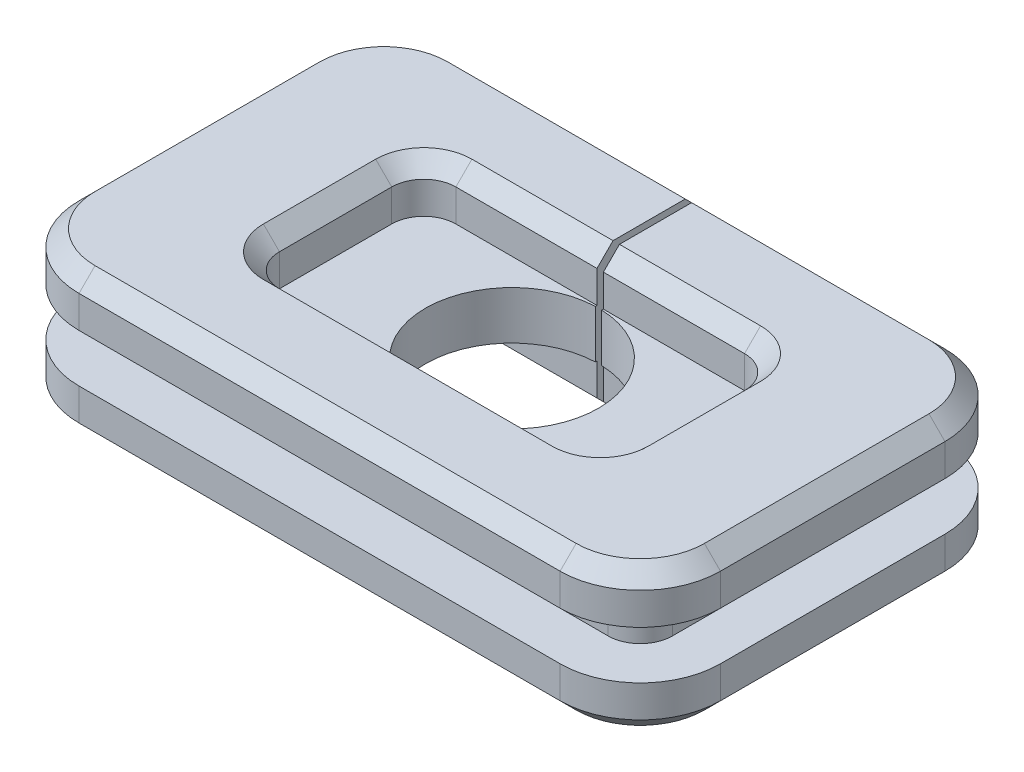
ISO-10303-21;
HEADER;
FILE_DESCRIPTION(('STEP AP214'),'2;1');
FILE_NAME('part.step','',(''),(''),'','','');
FILE_SCHEMA(('AUTOMOTIVE_DESIGN { 1 0 10303 214 1 1 1 1 }'));
ENDSEC;
DATA;
#1=APPLICATION_CONTEXT('core data for automotive mechanical design processes');
#2=APPLICATION_PROTOCOL_DEFINITION('international standard','automotive_design',2000,#1);
#3=PRODUCT_CONTEXT('',#1,'mechanical');
#4=PRODUCT('Part','Part','',(#3));
#5=PRODUCT_RELATED_PRODUCT_CATEGORY('part','',(#4));
#6=PRODUCT_DEFINITION_FORMATION('','',#4);
#7=PRODUCT_DEFINITION_CONTEXT('part definition',#1,'design');
#8=PRODUCT_DEFINITION('design','',#6,#7);
#9=PRODUCT_DEFINITION_SHAPE('','',#8);
#10=(LENGTH_UNIT() NAMED_UNIT(*) SI_UNIT(.MILLI.,.METRE.));
#11=(NAMED_UNIT(*) PLANE_ANGLE_UNIT() SI_UNIT($,.RADIAN.));
#12=(NAMED_UNIT(*) SI_UNIT($,.STERADIAN.) SOLID_ANGLE_UNIT());
#13=UNCERTAINTY_MEASURE_WITH_UNIT(LENGTH_MEASURE(1.E-05),#10,'distance_accuracy_value','');
#14=(GEOMETRIC_REPRESENTATION_CONTEXT(3) GLOBAL_UNCERTAINTY_ASSIGNED_CONTEXT((#13)) GLOBAL_UNIT_ASSIGNED_CONTEXT((#10,
#11,#12)) REPRESENTATION_CONTEXT('',''));
#15=CARTESIAN_POINT('',(0.,0.,0.));
#16=DIRECTION('',(0.,0.,1.));
#17=DIRECTION('',(1.,0.,0.));
#18=AXIS2_PLACEMENT_3D('',#15,#16,#17);
#19=CARTESIAN_POINT('',(-7.5,0.75,3.5));
#20=DIRECTION('',(0.,1.,0.));
#21=DIRECTION('',(0.,0.,1.));
#22=AXIS2_PLACEMENT_3D('',#19,#20,#21);
#23=PLANE('',#22);
#24=DIRECTION('',(0.,0.,1.));
#25=VECTOR('',#24,1.);
#26=CARTESIAN_POINT('',(0.1,0.75,3.5));
#27=LINE('',#26,#25);
#28=CARTESIAN_POINT('',(0.1,0.75,-6.));
#29=VERTEX_POINT('',#28);
#30=CARTESIAN_POINT('',(0.0999999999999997,0.75,-4.5));
#31=VERTEX_POINT('',#30);
#32=EDGE_CURVE('E699',#29,#31,#27,.T.);
#33=ORIENTED_EDGE('',*,*,#32,.F.);
#34=DIRECTION('',(1.,0.,0.));
#35=VECTOR('',#34,1.);
#36=CARTESIAN_POINT('',(7.5,0.75,-6.));
#37=LINE('',#36,#35);
#38=CARTESIAN_POINT('',(7.5,0.75,-6.));
#39=VERTEX_POINT('',#38);
#40=EDGE_CURVE('E625',#29,#39,#37,.T.);
#41=ORIENTED_EDGE('',*,*,#40,.T.);
#42=CARTESIAN_POINT('',(7.5,0.75,-3.5));
#43=DIRECTION('',(0.,-1.,0.));
#44=DIRECTION('',(0.,0.,-1.));
#45=AXIS2_PLACEMENT_3D('',#42,#43,#44);
#46=CIRCLE('',#45,2.5);
#47=CARTESIAN_POINT('',(10.,0.75,-3.5));
#48=VERTEX_POINT('',#47);
#49=EDGE_CURVE('E626',#48,#39,#46,.F.);
#50=ORIENTED_EDGE('',*,*,#49,.F.);
#51=DIRECTION('',(0.,0.,1.));
#52=VECTOR('',#51,1.);
#53=CARTESIAN_POINT('',(10.,0.75,3.5));
#54=LINE('',#53,#52);
#55=CARTESIAN_POINT('',(10.,0.75,3.5));
#56=VERTEX_POINT('',#55);
#57=EDGE_CURVE('E633',#48,#56,#54,.T.);
#58=ORIENTED_EDGE('',*,*,#57,.T.);
#59=CARTESIAN_POINT('',(7.5,0.75,3.5));
#60=DIRECTION('',(0.,-1.,0.));
#61=DIRECTION('',(0.,0.,-1.));
#62=AXIS2_PLACEMENT_3D('',#59,#60,#61);
#63=CIRCLE('',#62,2.5);
#64=CARTESIAN_POINT('',(7.5,0.75,6.));
#65=VERTEX_POINT('',#64);
#66=EDGE_CURVE('E630',#65,#56,#63,.F.);
#67=ORIENTED_EDGE('',*,*,#66,.F.);
#68=DIRECTION('',(-1.,0.,0.));
#69=VECTOR('',#68,1.);
#70=CARTESIAN_POINT('',(-7.5,0.75,6.));
#71=LINE('',#70,#69);
#72=CARTESIAN_POINT('',(-7.5,0.75,6.));
#73=VERTEX_POINT('',#72);
#74=EDGE_CURVE('E638',#65,#73,#71,.T.);
#75=ORIENTED_EDGE('',*,*,#74,.T.);
#76=CARTESIAN_POINT('',(-7.5,0.75,3.5));
#77=DIRECTION('',(0.,-1.,0.));
#78=DIRECTION('',(0.,0.,-1.));
#79=AXIS2_PLACEMENT_3D('',#76,#77,#78);
#80=CIRCLE('',#79,2.5);
#81=CARTESIAN_POINT('',(-10.,0.75,3.5));
#82=VERTEX_POINT('',#81);
#83=EDGE_CURVE('E635',#82,#73,#80,.F.);
#84=ORIENTED_EDGE('',*,*,#83,.F.);
#85=DIRECTION('',(0.,0.,-1.));
#86=VECTOR('',#85,1.);
#87=CARTESIAN_POINT('',(-10.,0.75,-3.5));
#88=LINE('',#87,#86);
#89=CARTESIAN_POINT('',(-10.,0.75,-3.5));
#90=VERTEX_POINT('',#89);
#91=EDGE_CURVE('E643',#82,#90,#88,.T.);
#92=ORIENTED_EDGE('',*,*,#91,.T.);
#93=CARTESIAN_POINT('',(-7.50000000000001,0.75,-3.5));
#94=DIRECTION('',(0.,-1.,0.));
#95=DIRECTION('',(0.,0.,-1.));
#96=AXIS2_PLACEMENT_3D('',#93,#94,#95);
#97=CIRCLE('',#96,2.5);
#98=CARTESIAN_POINT('',(-7.50000000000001,0.75,-6.));
#99=VERTEX_POINT('',#98);
#100=EDGE_CURVE('E640',#99,#90,#97,.F.);
#101=ORIENTED_EDGE('',*,*,#100,.F.);
#102=DIRECTION('',(1.,0.,0.));
#103=VECTOR('',#102,1.);
#104=CARTESIAN_POINT('',(7.5,0.75,-6.));
#105=LINE('',#104,#103);
#106=CARTESIAN_POINT('',(-0.1,0.75,-6.));
#107=VERTEX_POINT('',#106);
#108=EDGE_CURVE('E717',#99,#107,#105,.T.);
#109=ORIENTED_EDGE('',*,*,#108,.T.);
#110=DIRECTION('',(0.,0.,1.));
#111=VECTOR('',#110,1.);
#112=CARTESIAN_POINT('',(-0.1,0.75,3.5));
#113=LINE('',#112,#111);
#114=CARTESIAN_POINT('',(-0.0999999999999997,0.75,-4.5));
#115=VERTEX_POINT('',#114);
#116=EDGE_CURVE('E708',#115,#107,#113,.F.);
#117=ORIENTED_EDGE('',*,*,#116,.F.);
#118=DIRECTION('',(1.,0.,0.));
#119=VECTOR('',#118,1.);
#120=CARTESIAN_POINT('',(-8.5,0.75,-4.5));
#121=LINE('',#120,#119);
#122=CARTESIAN_POINT('',(-7.50000000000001,0.75,-4.5));
#123=VERTEX_POINT('',#122);
#124=EDGE_CURVE('E302',#115,#123,#121,.F.);
#125=ORIENTED_EDGE('',*,*,#124,.T.);
#126=CARTESIAN_POINT('',(-7.50000000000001,0.75,-3.5));
#127=DIRECTION('',(0.,-1.,0.));
#128=DIRECTION('',(0.,0.,-1.));
#129=AXIS2_PLACEMENT_3D('',#126,#127,#128);
#130=CIRCLE('',#129,1.);
#131=CARTESIAN_POINT('',(-8.5,0.75,-3.5));
#132=VERTEX_POINT('',#131);
#133=EDGE_CURVE('E20',#132,#123,#130,.T.);
#134=ORIENTED_EDGE('',*,*,#133,.F.);
#135=DIRECTION('',(0.,0.,-1.));
#136=VECTOR('',#135,1.);
#137=CARTESIAN_POINT('',(-8.5,0.75,-4.5));
#138=LINE('',#137,#136);
#139=CARTESIAN_POINT('',(-8.5,0.75,3.5));
#140=VERTEX_POINT('',#139);
#141=EDGE_CURVE('E673',#132,#140,#138,.F.);
#142=ORIENTED_EDGE('',*,*,#141,.T.);
#143=CARTESIAN_POINT('',(-7.5,0.75,3.5));
#144=DIRECTION('',(0.,-1.,0.));
#145=DIRECTION('',(0.,0.,-1.));
#146=AXIS2_PLACEMENT_3D('',#143,#144,#145);
#147=CIRCLE('',#146,1.);
#148=CARTESIAN_POINT('',(-7.5,0.75,4.5));
#149=VERTEX_POINT('',#148);
#150=EDGE_CURVE('E670',#149,#140,#147,.T.);
#151=ORIENTED_EDGE('',*,*,#150,.F.);
#152=DIRECTION('',(-1.,0.,0.));
#153=VECTOR('',#152,1.);
#154=CARTESIAN_POINT('',(-8.5,0.75,4.5));
#155=LINE('',#154,#153);
#156=CARTESIAN_POINT('',(7.5,0.75,4.5));
#157=VERTEX_POINT('',#156);
#158=EDGE_CURVE('E669',#149,#157,#155,.F.);
#159=ORIENTED_EDGE('',*,*,#158,.T.);
#160=CARTESIAN_POINT('',(7.5,0.75,3.5));
#161=DIRECTION('',(0.,-1.,0.));
#162=DIRECTION('',(0.,0.,-1.));
#163=AXIS2_PLACEMENT_3D('',#160,#161,#162);
#164=CIRCLE('',#163,1.);
#165=CARTESIAN_POINT('',(8.5,0.75,3.5));
#166=VERTEX_POINT('',#165);
#167=EDGE_CURVE('E666',#166,#157,#164,.T.);
#168=ORIENTED_EDGE('',*,*,#167,.F.);
#169=DIRECTION('',(0.,0.,1.));
#170=VECTOR('',#169,1.);
#171=CARTESIAN_POINT('',(8.5,0.75,-4.5));
#172=LINE('',#171,#170);
#173=CARTESIAN_POINT('',(8.5,0.75,-3.5));
#174=VERTEX_POINT('',#173);
#175=EDGE_CURVE('E665',#166,#174,#172,.F.);
#176=ORIENTED_EDGE('',*,*,#175,.T.);
#177=CARTESIAN_POINT('',(7.5,0.75,-3.5));
#178=DIRECTION('',(0.,-1.,0.));
#179=DIRECTION('',(0.,0.,-1.));
#180=AXIS2_PLACEMENT_3D('',#177,#178,#179);
#181=CIRCLE('',#180,1.);
#182=CARTESIAN_POINT('',(7.5,0.75,-4.5));
#183=VERTEX_POINT('',#182);
#184=EDGE_CURVE('E661',#183,#174,#181,.T.);
#185=ORIENTED_EDGE('',*,*,#184,.F.);
#186=DIRECTION('',(1.,0.,0.));
#187=VECTOR('',#186,1.);
#188=CARTESIAN_POINT('',(-8.5,0.75,-4.5));
#189=LINE('',#188,#187);
#190=EDGE_CURVE('E746',#183,#31,#189,.F.);
#191=ORIENTED_EDGE('',*,*,#190,.T.);
#192=EDGE_LOOP('',(#33,#41,#50,#58,#67,#75,#84,#92,#101,#109,#117,#125,#134,#142,#151,#159,#168,
#176,#185,#191));
#193=FACE_BOUND('',#192,.T.);
#194=ADVANCED_FACE('F17',(#193),#23,.F.);
#195=CARTESIAN_POINT('',(0.,0.75,0.));
#196=DIRECTION('',(0.,1.,0.));
#197=DIRECTION('',(0.,0.,1.));
#198=AXIS2_PLACEMENT_3D('',#195,#196,#197);
#199=PLANE('',#198);
#200=CARTESIAN_POINT('',(4.50000000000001,0.75,-1.75));
#201=DIRECTION('',(0.,-1.,0.));
#202=DIRECTION('',(0.,0.,-1.));
#203=AXIS2_PLACEMENT_3D('',#200,#201,#202);
#204=CIRCLE('',#203,1.);
#205=CARTESIAN_POINT('',(5.50000000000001,0.75,-1.75));
#206=VERTEX_POINT('',#205);
#207=CARTESIAN_POINT('',(4.50000000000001,0.75,-2.75));
#208=VERTEX_POINT('',#207);
#209=EDGE_CURVE('E657',#206,#208,#204,.F.);
#210=ORIENTED_EDGE('',*,*,#209,.T.);
#211=DIRECTION('',(1.,0.,0.));
#212=VECTOR('',#211,1.);
#213=CARTESIAN_POINT('',(5.50000000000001,0.75,-2.75));
#214=LINE('',#213,#212);
#215=CARTESIAN_POINT('',(0.1,0.75,-2.75));
#216=VERTEX_POINT('',#215);
#217=EDGE_CURVE('E660',#216,#208,#214,.T.);
#218=ORIENTED_EDGE('',*,*,#217,.F.);
#219=DIRECTION('',(0.,0.,1.));
#220=VECTOR('',#219,1.);
#221=CARTESIAN_POINT('',(0.1,0.75,0.));
#222=LINE('',#221,#220);
#223=CARTESIAN_POINT('',(0.1,0.75,-2.6981475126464));
#224=VERTEX_POINT('',#223);
#225=EDGE_CURVE('E690',#216,#224,#222,.T.);
#226=ORIENTED_EDGE('',*,*,#225,.T.);
#227=CARTESIAN_POINT('',(0.,0.75,0.));
#228=DIRECTION('',(0.,-1.,0.));
#229=DIRECTION('',(0.,0.,-1.));
#230=AXIS2_PLACEMENT_3D('',#227,#228,#229);
#231=CIRCLE('',#230,2.7);
#232=CARTESIAN_POINT('',(-0.0999999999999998,0.75,-2.6981475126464));
#233=VERTEX_POINT('',#232);
#234=EDGE_CURVE('E621',#224,#233,#231,.T.);
#235=ORIENTED_EDGE('',*,*,#234,.T.);
#236=DIRECTION('',(0.,0.,1.));
#237=VECTOR('',#236,1.);
#238=CARTESIAN_POINT('',(-0.1,0.75,0.));
#239=LINE('',#238,#237);
#240=CARTESIAN_POINT('',(-0.1,0.75,-2.75));
#241=VERTEX_POINT('',#240);
#242=EDGE_CURVE('E687',#233,#241,#239,.F.);
#243=ORIENTED_EDGE('',*,*,#242,.T.);
#244=DIRECTION('',(1.,0.,0.));
#245=VECTOR('',#244,1.);
#246=CARTESIAN_POINT('',(5.50000000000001,0.75,-2.75));
#247=LINE('',#246,#245);
#248=CARTESIAN_POINT('',(-4.5,0.75,-2.75));
#249=VERTEX_POINT('',#248);
#250=EDGE_CURVE('E721',#249,#241,#247,.T.);
#251=ORIENTED_EDGE('',*,*,#250,.F.);
#252=CARTESIAN_POINT('',(-4.5,0.75,-1.75));
#253=DIRECTION('',(0.,-1.,0.));
#254=DIRECTION('',(0.,0.,-1.));
#255=AXIS2_PLACEMENT_3D('',#252,#253,#254);
#256=CIRCLE('',#255,1.);
#257=CARTESIAN_POINT('',(-5.50000000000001,0.75,-1.75));
#258=VERTEX_POINT('',#257);
#259=EDGE_CURVE('E645',#249,#258,#256,.F.);
#260=ORIENTED_EDGE('',*,*,#259,.T.);
#261=DIRECTION('',(0.,0.,-1.));
#262=VECTOR('',#261,1.);
#263=CARTESIAN_POINT('',(-5.50000000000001,0.75,-2.75));
#264=LINE('',#263,#262);
#265=CARTESIAN_POINT('',(-5.50000000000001,0.75,1.75));
#266=VERTEX_POINT('',#265);
#267=EDGE_CURVE('E648',#266,#258,#264,.T.);
#268=ORIENTED_EDGE('',*,*,#267,.F.);
#269=CARTESIAN_POINT('',(-4.5,0.75,1.75));
#270=DIRECTION('',(0.,-1.,0.));
#271=DIRECTION('',(0.,0.,-1.));
#272=AXIS2_PLACEMENT_3D('',#269,#270,#271);
#273=CIRCLE('',#272,1.);
#274=CARTESIAN_POINT('',(-4.5,0.75,2.75));
#275=VERTEX_POINT('',#274);
#276=EDGE_CURVE('E649',#266,#275,#273,.F.);
#277=ORIENTED_EDGE('',*,*,#276,.T.);
#278=DIRECTION('',(-1.,0.,0.));
#279=VECTOR('',#278,1.);
#280=CARTESIAN_POINT('',(5.50000000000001,0.75,2.75));
#281=LINE('',#280,#279);
#282=CARTESIAN_POINT('',(4.50000000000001,0.75,2.75));
#283=VERTEX_POINT('',#282);
#284=EDGE_CURVE('E652',#283,#275,#281,.T.);
#285=ORIENTED_EDGE('',*,*,#284,.F.);
#286=CARTESIAN_POINT('',(4.50000000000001,0.75,1.75));
#287=DIRECTION('',(0.,-1.,0.));
#288=DIRECTION('',(0.,0.,-1.));
#289=AXIS2_PLACEMENT_3D('',#286,#287,#288);
#290=CIRCLE('',#289,1.);
#291=CARTESIAN_POINT('',(5.50000000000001,0.75,1.75));
#292=VERTEX_POINT('',#291);
#293=EDGE_CURVE('E653',#283,#292,#290,.F.);
#294=ORIENTED_EDGE('',*,*,#293,.T.);
#295=DIRECTION('',(0.,0.,1.));
#296=VECTOR('',#295,1.);
#297=CARTESIAN_POINT('',(5.50000000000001,0.75,-2.75));
#298=LINE('',#297,#296);
#299=EDGE_CURVE('E656',#206,#292,#298,.T.);
#300=ORIENTED_EDGE('',*,*,#299,.F.);
#301=EDGE_LOOP('',(#210,#218,#226,#235,#243,#251,#260,#268,#277,#285,#294,#300));
#302=FACE_BOUND('',#301,.T.);
#303=ADVANCED_FACE('F1774',(#302),#199,.T.);
#304=CARTESIAN_POINT('',(-8.5,0.75,-4.5));
#305=DIRECTION('',(0.,0.,1.));
#306=DIRECTION('',(1.,0.,0.));
#307=AXIS2_PLACEMENT_3D('',#304,#305,#306);
#308=PLANE('',#307);
#309=DIRECTION('',(0.,1.,0.));
#310=VECTOR('',#309,1.);
#311=CARTESIAN_POINT('',(-0.0999999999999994,0.75,-4.5));
#312=LINE('',#311,#310);
#313=CARTESIAN_POINT('',(-0.1,-0.75,-4.5));
#314=VERTEX_POINT('',#313);
#315=EDGE_CURVE('E309',#314,#115,#312,.T.);
#316=ORIENTED_EDGE('',*,*,#315,.F.);
#317=DIRECTION('',(1.,0.,0.));
#318=VECTOR('',#317,1.);
#319=CARTESIAN_POINT('',(-7.5,-0.75,-4.5));
#320=LINE('',#319,#318);
#321=CARTESIAN_POINT('',(-7.50000000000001,-0.75,-4.5));
#322=VERTEX_POINT('',#321);
#323=EDGE_CURVE('E620',#314,#322,#320,.F.);
#324=ORIENTED_EDGE('',*,*,#323,.T.);
#325=DIRECTION('',(0.,-1.,0.));
#326=VECTOR('',#325,1.);
#327=CARTESIAN_POINT('',(-7.50000000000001,0.75,-4.5));
#328=LINE('',#327,#326);
#329=EDGE_CURVE('E683',#123,#322,#328,.T.);
#330=ORIENTED_EDGE('',*,*,#329,.F.);
#331=ORIENTED_EDGE('',*,*,#124,.F.);
#332=EDGE_LOOP('',(#316,#324,#330,#331));
#333=FACE_BOUND('',#332,.T.);
#334=ADVANCED_FACE('F1822',(#333),#308,.F.);
#335=CARTESIAN_POINT('',(-7.50000000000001,0.75,-3.5));
#336=DIRECTION('',(0.,-1.,0.));
#337=DIRECTION('',(0.,0.,-1.));
#338=AXIS2_PLACEMENT_3D('',#335,#336,#337);
#339=CYLINDRICAL_SURFACE('',#338,1.);
#340=CARTESIAN_POINT('',(-7.50000000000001,-0.75,-3.5));
#341=DIRECTION('',(0.,-1.,0.));
#342=DIRECTION('',(0.,0.,-1.));
#343=AXIS2_PLACEMENT_3D('',#340,#341,#342);
#344=CIRCLE('',#343,1.);
#345=CARTESIAN_POINT('',(-8.5,-0.75,-3.5));
#346=VERTEX_POINT('',#345);
#347=EDGE_CURVE('E618',#322,#346,#344,.F.);
#348=ORIENTED_EDGE('',*,*,#347,.T.);
#349=DIRECTION('',(0.,1.,0.));
#350=VECTOR('',#349,1.);
#351=CARTESIAN_POINT('',(-8.5,0.75,-3.5));
#352=LINE('',#351,#350);
#353=EDGE_CURVE('E679',#346,#132,#352,.T.);
#354=ORIENTED_EDGE('',*,*,#353,.T.);
#355=ORIENTED_EDGE('',*,*,#133,.T.);
#356=ORIENTED_EDGE('',*,*,#329,.T.);
#357=EDGE_LOOP('',(#348,#354,#355,#356));
#358=FACE_BOUND('',#357,.T.);
#359=ADVANCED_FACE('F1827',(#358),#339,.T.);
#360=CARTESIAN_POINT('',(-8.5,0.75,-4.5));
#361=DIRECTION('',(1.,0.,0.));
#362=DIRECTION('',(0.,0.,-1.));
#363=AXIS2_PLACEMENT_3D('',#360,#361,#362);
#364=PLANE('',#363);
#365=DIRECTION('',(0.,-1.,0.));
#366=VECTOR('',#365,1.);
#367=CARTESIAN_POINT('',(-8.5,0.75,3.5));
#368=LINE('',#367,#366);
#369=CARTESIAN_POINT('',(-8.5,-0.75,3.5));
#370=VERTEX_POINT('',#369);
#371=EDGE_CURVE('E672',#140,#370,#368,.T.);
#372=ORIENTED_EDGE('',*,*,#371,.F.);
#373=ORIENTED_EDGE('',*,*,#141,.F.);
#374=ORIENTED_EDGE('',*,*,#353,.F.);
#375=DIRECTION('',(0.,0.,-1.));
#376=VECTOR('',#375,1.);
#377=CARTESIAN_POINT('',(-8.5,-0.75,3.5));
#378=LINE('',#377,#376);
#379=EDGE_CURVE('E617',#346,#370,#378,.F.);
#380=ORIENTED_EDGE('',*,*,#379,.T.);
#381=EDGE_LOOP('',(#372,#373,#374,#380));
#382=FACE_BOUND('',#381,.T.);
#383=ADVANCED_FACE('F1831',(#382),#364,.F.);
#384=CARTESIAN_POINT('',(-7.5,0.75,3.5));
#385=DIRECTION('',(0.,-1.,0.));
#386=DIRECTION('',(0.,0.,-1.));
#387=AXIS2_PLACEMENT_3D('',#384,#385,#386);
#388=CYLINDRICAL_SURFACE('',#387,1.);
#389=CARTESIAN_POINT('',(-7.5,-0.75,3.5));
#390=DIRECTION('',(0.,-1.,0.));
#391=DIRECTION('',(0.,0.,-1.));
#392=AXIS2_PLACEMENT_3D('',#389,#390,#391);
#393=CIRCLE('',#392,1.);
#394=CARTESIAN_POINT('',(-7.5,-0.75,4.5));
#395=VERTEX_POINT('',#394);
#396=EDGE_CURVE('E615',#370,#395,#393,.F.);
#397=ORIENTED_EDGE('',*,*,#396,.T.);
#398=DIRECTION('',(0.,1.,0.));
#399=VECTOR('',#398,1.);
#400=CARTESIAN_POINT('',(-7.5,0.75,4.5));
#401=LINE('',#400,#399);
#402=EDGE_CURVE('E677',#395,#149,#401,.T.);
#403=ORIENTED_EDGE('',*,*,#402,.T.);
#404=ORIENTED_EDGE('',*,*,#150,.T.);
#405=ORIENTED_EDGE('',*,*,#371,.T.);
#406=EDGE_LOOP('',(#397,#403,#404,#405));
#407=FACE_BOUND('',#406,.T.);
#408=ADVANCED_FACE('F784',(#407),#388,.T.);
#409=CARTESIAN_POINT('',(-8.5,0.75,4.5));
#410=DIRECTION('',(0.,0.,-1.));
#411=DIRECTION('',(-1.,0.,0.));
#412=AXIS2_PLACEMENT_3D('',#409,#410,#411);
#413=PLANE('',#412);
#414=DIRECTION('',(0.,-1.,0.));
#415=VECTOR('',#414,1.);
#416=CARTESIAN_POINT('',(7.5,0.75,4.5));
#417=LINE('',#416,#415);
#418=CARTESIAN_POINT('',(7.5,-0.75,4.5));
#419=VERTEX_POINT('',#418);
#420=EDGE_CURVE('E668',#157,#419,#417,.T.);
#421=ORIENTED_EDGE('',*,*,#420,.F.);
#422=ORIENTED_EDGE('',*,*,#158,.F.);
#423=ORIENTED_EDGE('',*,*,#402,.F.);
#424=DIRECTION('',(1.,0.,0.));
#425=VECTOR('',#424,1.);
#426=CARTESIAN_POINT('',(-7.5,-0.75,4.5));
#427=LINE('',#426,#425);
#428=EDGE_CURVE('E614',#395,#419,#427,.T.);
#429=ORIENTED_EDGE('',*,*,#428,.T.);
#430=EDGE_LOOP('',(#421,#422,#423,#429));
#431=FACE_BOUND('',#430,.T.);
#432=ADVANCED_FACE('F769',(#431),#413,.F.);
#433=CARTESIAN_POINT('',(7.5,0.75,3.5));
#434=DIRECTION('',(0.,-1.,0.));
#435=DIRECTION('',(0.,0.,-1.));
#436=AXIS2_PLACEMENT_3D('',#433,#434,#435);
#437=CYLINDRICAL_SURFACE('',#436,1.);
#438=CARTESIAN_POINT('',(7.5,-0.75,3.5));
#439=DIRECTION('',(0.,-1.,0.));
#440=DIRECTION('',(0.,0.,-1.));
#441=AXIS2_PLACEMENT_3D('',#438,#439,#440);
#442=CIRCLE('',#441,1.);
#443=CARTESIAN_POINT('',(8.5,-0.75,3.5));
#444=VERTEX_POINT('',#443);
#445=EDGE_CURVE('E612',#419,#444,#442,.F.);
#446=ORIENTED_EDGE('',*,*,#445,.T.);
#447=DIRECTION('',(0.,1.,0.));
#448=VECTOR('',#447,1.);
#449=CARTESIAN_POINT('',(8.5,0.75,3.5));
#450=LINE('',#449,#448);
#451=EDGE_CURVE('E752',#444,#166,#450,.T.);
#452=ORIENTED_EDGE('',*,*,#451,.T.);
#453=ORIENTED_EDGE('',*,*,#167,.T.);
#454=ORIENTED_EDGE('',*,*,#420,.T.);
#455=EDGE_LOOP('',(#446,#452,#453,#454));
#456=FACE_BOUND('',#455,.T.);
#457=ADVANCED_FACE('F772',(#456),#437,.T.);
#458=CARTESIAN_POINT('',(8.5,0.75,-4.5));
#459=DIRECTION('',(-1.,0.,0.));
#460=DIRECTION('',(0.,0.,1.));
#461=AXIS2_PLACEMENT_3D('',#458,#459,#460);
#462=PLANE('',#461);
#463=ORIENTED_EDGE('',*,*,#451,.F.);
#464=DIRECTION('',(0.,0.,-1.));
#465=VECTOR('',#464,1.);
#466=CARTESIAN_POINT('',(8.5,-0.75,3.5));
#467=LINE('',#466,#465);
#468=CARTESIAN_POINT('',(8.5,-0.75,-3.5));
#469=VERTEX_POINT('',#468);
#470=EDGE_CURVE('E611',#444,#469,#467,.T.);
#471=ORIENTED_EDGE('',*,*,#470,.T.);
#472=DIRECTION('',(0.,-1.,0.));
#473=VECTOR('',#472,1.);
#474=CARTESIAN_POINT('',(8.5,0.75,-3.5));
#475=LINE('',#474,#473);
#476=EDGE_CURVE('E664',#174,#469,#475,.T.);
#477=ORIENTED_EDGE('',*,*,#476,.F.);
#478=ORIENTED_EDGE('',*,*,#175,.F.);
#479=EDGE_LOOP('',(#463,#471,#477,#478));
#480=FACE_BOUND('',#479,.T.);
#481=ADVANCED_FACE('F774',(#480),#462,.F.);
#482=CARTESIAN_POINT('',(7.5,0.75,-3.5));
#483=DIRECTION('',(0.,-1.,0.));
#484=DIRECTION('',(0.,0.,-1.));
#485=AXIS2_PLACEMENT_3D('',#482,#483,#484);
#486=CYLINDRICAL_SURFACE('',#485,1.);
#487=CARTESIAN_POINT('',(7.5,-0.75,-3.5));
#488=DIRECTION('',(0.,-1.,0.));
#489=DIRECTION('',(0.,0.,-1.));
#490=AXIS2_PLACEMENT_3D('',#487,#488,#489);
#491=CIRCLE('',#490,1.);
#492=CARTESIAN_POINT('',(7.5,-0.75,-4.5));
#493=VERTEX_POINT('',#492);
#494=EDGE_CURVE('E608',#469,#493,#491,.F.);
#495=ORIENTED_EDGE('',*,*,#494,.T.);
#496=DIRECTION('',(0.,1.,0.));
#497=VECTOR('',#496,1.);
#498=CARTESIAN_POINT('',(7.5,0.75,-4.5));
#499=LINE('',#498,#497);
#500=EDGE_CURVE('E750',#493,#183,#499,.T.);
#501=ORIENTED_EDGE('',*,*,#500,.T.);
#502=ORIENTED_EDGE('',*,*,#184,.T.);
#503=ORIENTED_EDGE('',*,*,#476,.T.);
#504=EDGE_LOOP('',(#495,#501,#502,#503));
#505=FACE_BOUND('',#504,.T.);
#506=ADVANCED_FACE('F781',(#505),#486,.T.);
#507=CARTESIAN_POINT('',(-8.5,0.75,-4.5));
#508=DIRECTION('',(0.,0.,1.));
#509=DIRECTION('',(1.,0.,0.));
#510=AXIS2_PLACEMENT_3D('',#507,#508,#509);
#511=PLANE('',#510);
#512=DIRECTION('',(0.,1.,0.));
#513=VECTOR('',#512,1.);
#514=CARTESIAN_POINT('',(0.0999999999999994,0.75,-4.5));
#515=LINE('',#514,#513);
#516=CARTESIAN_POINT('',(0.0999999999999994,-0.75,-4.5));
#517=VERTEX_POINT('',#516);
#518=EDGE_CURVE('E749',#31,#517,#515,.F.);
#519=ORIENTED_EDGE('',*,*,#518,.F.);
#520=ORIENTED_EDGE('',*,*,#190,.F.);
#521=ORIENTED_EDGE('',*,*,#500,.F.);
#522=DIRECTION('',(1.,0.,0.));
#523=VECTOR('',#522,1.);
#524=CARTESIAN_POINT('',(-7.5,-0.75,-4.5));
#525=LINE('',#524,#523);
#526=EDGE_CURVE('E610',#493,#517,#525,.F.);
#527=ORIENTED_EDGE('',*,*,#526,.T.);
#528=EDGE_LOOP('',(#519,#520,#521,#527));
#529=FACE_BOUND('',#528,.T.);
#530=ADVANCED_FACE('F1096',(#529),#511,.F.);
#531=CARTESIAN_POINT('',(5.50000000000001,0.75,-2.75));
#532=DIRECTION('',(0.,0.,1.));
#533=DIRECTION('',(1.,0.,0.));
#534=AXIS2_PLACEMENT_3D('',#531,#532,#533);
#535=PLANE('',#534);
#536=DIRECTION('',(0.,-1.,0.));
#537=VECTOR('',#536,1.);
#538=CARTESIAN_POINT('',(4.50000000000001,0.75,-2.75));
#539=LINE('',#538,#537);
#540=CARTESIAN_POINT('',(4.50000000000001,1.74999999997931,-2.75000000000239));
#541=VERTEX_POINT('',#540);
#542=EDGE_CURVE('E659',#208,#541,#539,.F.);
#543=ORIENTED_EDGE('',*,*,#542,.T.);
#544=DIRECTION('',(1.,0.,0.));
#545=VECTOR('',#544,1.);
#546=CARTESIAN_POINT('',(-7.5,1.75,-2.75));
#547=LINE('',#546,#545);
#548=CARTESIAN_POINT('',(0.100000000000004,1.75,-2.75));
#549=VERTEX_POINT('',#548);
#550=EDGE_CURVE('E1119',#541,#549,#547,.F.);
#551=ORIENTED_EDGE('',*,*,#550,.T.);
#552=DIRECTION('',(0.,1.,0.));
#553=VECTOR('',#552,1.);
#554=CARTESIAN_POINT('',(0.1,0.75,-2.75));
#555=LINE('',#554,#553);
#556=EDGE_CURVE('E743',#549,#216,#555,.F.);
#557=ORIENTED_EDGE('',*,*,#556,.T.);
#558=ORIENTED_EDGE('',*,*,#217,.T.);
#559=EDGE_LOOP('',(#543,#551,#557,#558));
#560=FACE_BOUND('',#559,.T.);
#561=ADVANCED_FACE('F1092',(#560),#535,.T.);
#562=CARTESIAN_POINT('',(4.50000000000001,0.75,-1.75));
#563=DIRECTION('',(0.,-1.,0.));
#564=DIRECTION('',(0.,0.,-1.));
#565=AXIS2_PLACEMENT_3D('',#562,#563,#564);
#566=CYLINDRICAL_SURFACE('',#565,1.);
#567=CARTESIAN_POINT('',(4.50000000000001,1.74999999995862,-1.75));
#568=DIRECTION('',(0.,1.,0.));
#569=DIRECTION('',(0.,0.,1.));
#570=AXIS2_PLACEMENT_3D('',#567,#568,#569);
#571=CIRCLE('',#570,1.00000000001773);
#572=CARTESIAN_POINT('',(5.50000000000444,1.74999999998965,-1.75));
#573=VERTEX_POINT('',#572);
#574=EDGE_CURVE('E1313',#573,#541,#571,.T.);
#575=ORIENTED_EDGE('',*,*,#574,.T.);
#576=ORIENTED_EDGE('',*,*,#542,.F.);
#577=ORIENTED_EDGE('',*,*,#209,.F.);
#578=DIRECTION('',(0.,1.,0.));
#579=VECTOR('',#578,1.);
#580=CARTESIAN_POINT('',(5.50000000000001,0.75,-1.75));
#581=LINE('',#580,#579);
#582=EDGE_CURVE('E740',#573,#206,#581,.F.);
#583=ORIENTED_EDGE('',*,*,#582,.F.);
#584=EDGE_LOOP('',(#575,#576,#577,#583));
#585=FACE_BOUND('',#584,.T.);
#586=ADVANCED_FACE('F1088',(#585),#566,.F.);
#587=CARTESIAN_POINT('',(5.50000000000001,0.75,-2.75));
#588=DIRECTION('',(-1.,0.,0.));
#589=DIRECTION('',(0.,0.,1.));
#590=AXIS2_PLACEMENT_3D('',#587,#588,#589);
#591=PLANE('',#590);
#592=ORIENTED_EDGE('',*,*,#582,.T.);
#593=ORIENTED_EDGE('',*,*,#299,.T.);
#594=DIRECTION('',(0.,-1.,0.));
#595=VECTOR('',#594,1.);
#596=CARTESIAN_POINT('',(5.50000000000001,0.75,1.75));
#597=LINE('',#596,#595);
#598=CARTESIAN_POINT('',(5.49999999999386,1.74999999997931,1.75));
#599=VERTEX_POINT('',#598);
#600=EDGE_CURVE('E655',#292,#599,#597,.F.);
#601=ORIENTED_EDGE('',*,*,#600,.T.);
#602=DIRECTION('',(0.,0.,1.));
#603=VECTOR('',#602,1.);
#604=CARTESIAN_POINT('',(5.50000000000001,1.75,3.5));
#605=LINE('',#604,#603);
#606=EDGE_CURVE('E1304',#599,#573,#605,.F.);
#607=ORIENTED_EDGE('',*,*,#606,.T.);
#608=EDGE_LOOP('',(#592,#593,#601,#607));
#609=FACE_BOUND('',#608,.T.);
#610=ADVANCED_FACE('F1084',(#609),#591,.T.);
#611=CARTESIAN_POINT('',(4.50000000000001,0.75,1.75));
#612=DIRECTION('',(0.,-1.,0.));
#613=DIRECTION('',(0.,0.,-1.));
#614=AXIS2_PLACEMENT_3D('',#611,#612,#613);
#615=CYLINDRICAL_SURFACE('',#614,1.);
#616=CARTESIAN_POINT('',(4.50000000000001,1.74999999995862,1.75));
#617=DIRECTION('',(0.,1.,0.));
#618=DIRECTION('',(0.,0.,1.));
#619=AXIS2_PLACEMENT_3D('',#616,#617,#618);
#620=CIRCLE('',#619,0.999999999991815);
#621=CARTESIAN_POINT('',(4.50000000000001,1.74999999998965,2.74999999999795));
#622=VERTEX_POINT('',#621);
#623=EDGE_CURVE('E1294',#622,#599,#620,.T.);
#624=ORIENTED_EDGE('',*,*,#623,.T.);
#625=ORIENTED_EDGE('',*,*,#600,.F.);
#626=ORIENTED_EDGE('',*,*,#293,.F.);
#627=DIRECTION('',(0.,1.,0.));
#628=VECTOR('',#627,1.);
#629=CARTESIAN_POINT('',(4.50000000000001,0.75,2.75));
#630=LINE('',#629,#628);
#631=EDGE_CURVE('E737',#622,#283,#630,.F.);
#632=ORIENTED_EDGE('',*,*,#631,.F.);
#633=EDGE_LOOP('',(#624,#625,#626,#632));
#634=FACE_BOUND('',#633,.T.);
#635=ADVANCED_FACE('F1080',(#634),#615,.F.);
#636=CARTESIAN_POINT('',(5.50000000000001,0.75,2.75));
#637=DIRECTION('',(0.,0.,-1.));
#638=DIRECTION('',(-1.,0.,0.));
#639=AXIS2_PLACEMENT_3D('',#636,#637,#638);
#640=PLANE('',#639);
#641=ORIENTED_EDGE('',*,*,#631,.T.);
#642=ORIENTED_EDGE('',*,*,#284,.T.);
#643=DIRECTION('',(0.,-1.,0.));
#644=VECTOR('',#643,1.);
#645=CARTESIAN_POINT('',(-4.5,0.75,2.75));
#646=LINE('',#645,#644);
#647=CARTESIAN_POINT('',(-4.5,1.74999999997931,2.74999999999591));
#648=VERTEX_POINT('',#647);
#649=EDGE_CURVE('E651',#275,#648,#646,.F.);
#650=ORIENTED_EDGE('',*,*,#649,.T.);
#651=DIRECTION('',(1.,0.,0.));
#652=VECTOR('',#651,1.);
#653=CARTESIAN_POINT('',(-7.5,1.75,2.75));
#654=LINE('',#653,#652);
#655=EDGE_CURVE('E1285',#648,#622,#654,.T.);
#656=ORIENTED_EDGE('',*,*,#655,.T.);
#657=EDGE_LOOP('',(#641,#642,#650,#656));
#658=FACE_BOUND('',#657,.T.);
#659=ADVANCED_FACE('F1076',(#658),#640,.T.);
#660=CARTESIAN_POINT('',(-4.5,0.75,1.75));
#661=DIRECTION('',(0.,-1.,0.));
#662=DIRECTION('',(0.,0.,-1.));
#663=AXIS2_PLACEMENT_3D('',#660,#661,#662);
#664=CYLINDRICAL_SURFACE('',#663,1.);
#665=CARTESIAN_POINT('',(-4.5,1.74999999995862,1.75));
#666=DIRECTION('',(0.,1.,0.));
#667=DIRECTION('',(0.,0.,1.));
#668=AXIS2_PLACEMENT_3D('',#665,#666,#667);
#669=CIRCLE('',#668,0.999999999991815);
#670=CARTESIAN_POINT('',(-5.49999999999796,1.74999999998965,1.75));
#671=VERTEX_POINT('',#670);
#672=EDGE_CURVE('E1275',#671,#648,#669,.T.);
#673=ORIENTED_EDGE('',*,*,#672,.T.);
#674=ORIENTED_EDGE('',*,*,#649,.F.);
#675=ORIENTED_EDGE('',*,*,#276,.F.);
#676=DIRECTION('',(0.,1.,0.));
#677=VECTOR('',#676,1.);
#678=CARTESIAN_POINT('',(-5.50000000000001,0.75,1.75));
#679=LINE('',#678,#677);
#680=EDGE_CURVE('E734',#671,#266,#679,.F.);
#681=ORIENTED_EDGE('',*,*,#680,.F.);
#682=EDGE_LOOP('',(#673,#674,#675,#681));
#683=FACE_BOUND('',#682,.T.);
#684=ADVANCED_FACE('F1072',(#683),#664,.F.);
#685=CARTESIAN_POINT('',(-5.50000000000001,0.75,-2.75));
#686=DIRECTION('',(1.,0.,0.));
#687=DIRECTION('',(0.,0.,-1.));
#688=AXIS2_PLACEMENT_3D('',#685,#686,#687);
#689=PLANE('',#688);
#690=ORIENTED_EDGE('',*,*,#680,.T.);
#691=ORIENTED_EDGE('',*,*,#267,.T.);
#692=DIRECTION('',(0.,-1.,0.));
#693=VECTOR('',#692,1.);
#694=CARTESIAN_POINT('',(-5.5,0.75,-1.75));
#695=LINE('',#694,#693);
#696=CARTESIAN_POINT('',(-5.50000000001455,1.74999999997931,-1.75));
#697=VERTEX_POINT('',#696);
#698=EDGE_CURVE('E647',#258,#697,#695,.F.);
#699=ORIENTED_EDGE('',*,*,#698,.T.);
#700=DIRECTION('',(0.,0.,1.));
#701=VECTOR('',#700,1.);
#702=CARTESIAN_POINT('',(-5.5,1.75,3.5));
#703=LINE('',#702,#701);
#704=EDGE_CURVE('E1266',#697,#671,#703,.T.);
#705=ORIENTED_EDGE('',*,*,#704,.T.);
#706=EDGE_LOOP('',(#690,#691,#699,#705));
#707=FACE_BOUND('',#706,.T.);
#708=ADVANCED_FACE('F1068',(#707),#689,.T.);
#709=CARTESIAN_POINT('',(-4.5,0.75,-1.75));
#710=DIRECTION('',(0.,-1.,0.));
#711=DIRECTION('',(0.,0.,-1.));
#712=AXIS2_PLACEMENT_3D('',#709,#710,#711);
#713=CYLINDRICAL_SURFACE('',#712,1.);
#714=CARTESIAN_POINT('',(-4.5,1.74999999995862,-1.75));
#715=DIRECTION('',(0.,1.,0.));
#716=DIRECTION('',(0.,0.,1.));
#717=AXIS2_PLACEMENT_3D('',#714,#715,#716);
#718=CIRCLE('',#717,1.00000000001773);
#719=CARTESIAN_POINT('',(-4.5,1.74999999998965,-2.75000000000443));
#720=VERTEX_POINT('',#719);
#721=EDGE_CURVE('E1252',#720,#697,#718,.T.);
#722=ORIENTED_EDGE('',*,*,#721,.T.);
#723=ORIENTED_EDGE('',*,*,#698,.F.);
#724=ORIENTED_EDGE('',*,*,#259,.F.);
#725=DIRECTION('',(0.,1.,0.));
#726=VECTOR('',#725,1.);
#727=CARTESIAN_POINT('',(-4.5,0.75,-2.75));
#728=LINE('',#727,#726);
#729=EDGE_CURVE('E729',#720,#249,#728,.F.);
#730=ORIENTED_EDGE('',*,*,#729,.F.);
#731=EDGE_LOOP('',(#722,#723,#724,#730));
#732=FACE_BOUND('',#731,.T.);
#733=ADVANCED_FACE('F1064',(#732),#713,.F.);
#734=CARTESIAN_POINT('',(5.50000000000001,0.75,-2.75));
#735=DIRECTION('',(0.,0.,1.));
#736=DIRECTION('',(1.,0.,0.));
#737=AXIS2_PLACEMENT_3D('',#734,#735,#736);
#738=PLANE('',#737);
#739=ORIENTED_EDGE('',*,*,#729,.T.);
#740=ORIENTED_EDGE('',*,*,#250,.T.);
#741=DIRECTION('',(0.,1.,0.));
#742=VECTOR('',#741,1.);
#743=CARTESIAN_POINT('',(-0.1,0.75,-2.75));
#744=LINE('',#743,#742);
#745=CARTESIAN_POINT('',(-0.0999999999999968,1.75,-2.75));
#746=VERTEX_POINT('',#745);
#747=EDGE_CURVE('E1258',#241,#746,#744,.T.);
#748=ORIENTED_EDGE('',*,*,#747,.T.);
#749=DIRECTION('',(1.,0.,0.));
#750=VECTOR('',#749,1.);
#751=CARTESIAN_POINT('',(-7.5,1.75,-2.75));
#752=LINE('',#751,#750);
#753=EDGE_CURVE('E1245',#746,#720,#752,.F.);
#754=ORIENTED_EDGE('',*,*,#753,.T.);
#755=EDGE_LOOP('',(#739,#740,#748,#754));
#756=FACE_BOUND('',#755,.T.);
#757=ADVANCED_FACE('F1060',(#756),#738,.T.);
#758=CARTESIAN_POINT('',(7.5,2.25,-6.));
#759=DIRECTION('',(0.,0.,1.));
#760=DIRECTION('',(1.,0.,0.));
#761=AXIS2_PLACEMENT_3D('',#758,#759,#760);
#762=PLANE('',#761);
#763=DIRECTION('',(0.,1.,0.));
#764=VECTOR('',#763,1.);
#765=CARTESIAN_POINT('',(-0.1,2.25,-6.));
#766=LINE('',#765,#764);
#767=CARTESIAN_POINT('',(-0.1,1.75,-6.));
#768=VERTEX_POINT('',#767);
#769=EDGE_CURVE('E720',#107,#768,#766,.T.);
#770=ORIENTED_EDGE('',*,*,#769,.F.);
#771=ORIENTED_EDGE('',*,*,#108,.F.);
#772=DIRECTION('',(0.,-1.,0.));
#773=VECTOR('',#772,1.);
#774=CARTESIAN_POINT('',(-7.50000000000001,2.25,-6.));
#775=LINE('',#774,#773);
#776=CARTESIAN_POINT('',(-7.50000000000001,1.75000000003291,-5.99999999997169));
#777=VERTEX_POINT('',#776);
#778=EDGE_CURVE('E644',#777,#99,#775,.T.);
#779=ORIENTED_EDGE('',*,*,#778,.F.);
#780=DIRECTION('',(1.,0.,0.));
#781=VECTOR('',#780,1.);
#782=CARTESIAN_POINT('',(-7.5,1.75,-6.));
#783=LINE('',#782,#781);
#784=EDGE_CURVE('E1236',#768,#777,#783,.F.);
#785=ORIENTED_EDGE('',*,*,#784,.F.);
#786=EDGE_LOOP('',(#770,#771,#779,#785));
#787=FACE_BOUND('',#786,.T.);
#788=ADVANCED_FACE('F1056',(#787),#762,.F.);
#789=CARTESIAN_POINT('',(-7.50000000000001,2.25,-3.5));
#790=DIRECTION('',(0.,-1.,0.));
#791=DIRECTION('',(0.,0.,-1.));
#792=AXIS2_PLACEMENT_3D('',#789,#790,#791);
#793=CYLINDRICAL_SURFACE('',#792,2.5);
#794=ORIENTED_EDGE('',*,*,#778,.T.);
#795=ORIENTED_EDGE('',*,*,#100,.T.);
#796=DIRECTION('',(0.,1.,0.));
#797=VECTOR('',#796,1.);
#798=CARTESIAN_POINT('',(-10.,2.25,-3.5));
#799=LINE('',#798,#797);
#800=CARTESIAN_POINT('',(-9.99999999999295,1.75000000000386,-3.5));
#801=VERTEX_POINT('',#800);
#802=EDGE_CURVE('E716',#90,#801,#799,.T.);
#803=ORIENTED_EDGE('',*,*,#802,.T.);
#804=CARTESIAN_POINT('',(-7.50000000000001,1.75000000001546,-3.5));
#805=DIRECTION('',(0.,-1.,0.));
#806=DIRECTION('',(0.,0.,-1.));
#807=AXIS2_PLACEMENT_3D('',#804,#805,#806);
#808=CIRCLE('',#807,2.49999999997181);
#809=EDGE_CURVE('E1226',#777,#801,#808,.F.);
#810=ORIENTED_EDGE('',*,*,#809,.F.);
#811=EDGE_LOOP('',(#794,#795,#803,#810));
#812=FACE_BOUND('',#811,.T.);
#813=ADVANCED_FACE('F1052',(#812),#793,.T.);
#814=CARTESIAN_POINT('',(-10.,2.25,-3.5));
#815=DIRECTION('',(1.,0.,0.));
#816=DIRECTION('',(0.,0.,-1.));
#817=AXIS2_PLACEMENT_3D('',#814,#815,#816);
#818=PLANE('',#817);
#819=DIRECTION('',(0.,0.,1.));
#820=VECTOR('',#819,1.);
#821=CARTESIAN_POINT('',(-10.,1.75,3.5));
#822=LINE('',#821,#820);
#823=CARTESIAN_POINT('',(-10.0000000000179,1.74999999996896,3.5));
#824=VERTEX_POINT('',#823);
#825=EDGE_CURVE('E1217',#801,#824,#822,.T.);
#826=ORIENTED_EDGE('',*,*,#825,.F.);
#827=ORIENTED_EDGE('',*,*,#802,.F.);
#828=ORIENTED_EDGE('',*,*,#91,.F.);
#829=DIRECTION('',(0.,-1.,0.));
#830=VECTOR('',#829,1.);
#831=CARTESIAN_POINT('',(-10.,2.25,3.5));
#832=LINE('',#831,#830);
#833=EDGE_CURVE('E639',#824,#82,#832,.T.);
#834=ORIENTED_EDGE('',*,*,#833,.F.);
#835=EDGE_LOOP('',(#826,#827,#828,#834));
#836=FACE_BOUND('',#835,.T.);
#837=ADVANCED_FACE('F1048',(#836),#818,.F.);
#838=CARTESIAN_POINT('',(-7.5,2.25,3.5));
#839=DIRECTION('',(0.,-1.,0.));
#840=DIRECTION('',(0.,0.,-1.));
#841=AXIS2_PLACEMENT_3D('',#838,#839,#840);
#842=CYLINDRICAL_SURFACE('',#841,2.5);
#843=ORIENTED_EDGE('',*,*,#833,.T.);
#844=ORIENTED_EDGE('',*,*,#83,.T.);
#845=DIRECTION('',(0.,1.,0.));
#846=VECTOR('',#845,1.);
#847=CARTESIAN_POINT('',(-7.5,2.25,6.));
#848=LINE('',#847,#846);
#849=CARTESIAN_POINT('',(-7.5,1.74999999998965,6.00000000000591));
#850=VERTEX_POINT('',#849);
#851=EDGE_CURVE('E714',#73,#850,#848,.T.);
#852=ORIENTED_EDGE('',*,*,#851,.T.);
#853=CARTESIAN_POINT('',(-7.5,1.74999999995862,3.5));
#854=DIRECTION('',(0.,-1.,0.));
#855=DIRECTION('',(0.,0.,-1.));
#856=AXIS2_PLACEMENT_3D('',#853,#854,#855);
#857=CIRCLE('',#856,2.50000000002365);
#858=EDGE_CURVE('E1207',#824,#850,#857,.F.);
#859=ORIENTED_EDGE('',*,*,#858,.F.);
#860=EDGE_LOOP('',(#843,#844,#852,#859));
#861=FACE_BOUND('',#860,.T.);
#862=ADVANCED_FACE('F1044',(#861),#842,.T.);
#863=CARTESIAN_POINT('',(-7.5,2.25,6.));
#864=DIRECTION('',(0.,0.,-1.));
#865=DIRECTION('',(-1.,0.,0.));
#866=AXIS2_PLACEMENT_3D('',#863,#864,#865);
#867=PLANE('',#866);
#868=DIRECTION('',(1.,0.,0.));
#869=VECTOR('',#868,1.);
#870=CARTESIAN_POINT('',(-7.5,1.75,6.));
#871=LINE('',#870,#869);
#872=CARTESIAN_POINT('',(7.5,1.75000000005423,5.99999999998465));
#873=VERTEX_POINT('',#872);
#874=EDGE_CURVE('E1198',#850,#873,#871,.T.);
#875=ORIENTED_EDGE('',*,*,#874,.F.);
#876=ORIENTED_EDGE('',*,*,#851,.F.);
#877=ORIENTED_EDGE('',*,*,#74,.F.);
#878=DIRECTION('',(0.,-1.,0.));
#879=VECTOR('',#878,1.);
#880=CARTESIAN_POINT('',(7.5,2.25,6.));
#881=LINE('',#880,#879);
#882=EDGE_CURVE('E634',#873,#65,#881,.T.);
#883=ORIENTED_EDGE('',*,*,#882,.F.);
#884=EDGE_LOOP('',(#875,#876,#877,#883));
#885=FACE_BOUND('',#884,.T.);
#886=ADVANCED_FACE('F1040',(#885),#867,.F.);
#887=CARTESIAN_POINT('',(7.5,2.25,3.5));
#888=DIRECTION('',(0.,-1.,0.));
#889=DIRECTION('',(0.,0.,-1.));
#890=AXIS2_PLACEMENT_3D('',#887,#888,#889);
#891=CYLINDRICAL_SURFACE('',#890,2.5);
#892=ORIENTED_EDGE('',*,*,#882,.T.);
#893=ORIENTED_EDGE('',*,*,#66,.T.);
#894=DIRECTION('',(0.,1.,0.));
#895=VECTOR('',#894,1.);
#896=CARTESIAN_POINT('',(10.,2.25,3.5));
#897=LINE('',#896,#895);
#898=CARTESIAN_POINT('',(9.9999999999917,1.75000000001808,3.5));
#899=VERTEX_POINT('',#898);
#900=EDGE_CURVE('E712',#56,#899,#897,.T.);
#901=ORIENTED_EDGE('',*,*,#900,.T.);
#902=CARTESIAN_POINT('',(7.5,1.7500000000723,3.5));
#903=DIRECTION('',(0.,-1.,0.));
#904=DIRECTION('',(0.,0.,-1.));
#905=AXIS2_PLACEMENT_3D('',#902,#903,#904);
#906=CIRCLE('',#905,2.4999999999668);
#907=EDGE_CURVE('E1188',#873,#899,#906,.F.);
#908=ORIENTED_EDGE('',*,*,#907,.F.);
#909=EDGE_LOOP('',(#892,#893,#901,#908));
#910=FACE_BOUND('',#909,.T.);
#911=ADVANCED_FACE('F1036',(#910),#891,.T.);
#912=CARTESIAN_POINT('',(10.,2.25,3.5));
#913=DIRECTION('',(-1.,0.,0.));
#914=DIRECTION('',(0.,0.,1.));
#915=AXIS2_PLACEMENT_3D('',#912,#913,#914);
#916=PLANE('',#915);
#917=DIRECTION('',(0.,0.,1.));
#918=VECTOR('',#917,1.);
#919=CARTESIAN_POINT('',(10.,1.75,3.49999999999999));
#920=LINE('',#919,#918);
#921=CARTESIAN_POINT('',(9.99999999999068,1.7500000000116,-3.5));
#922=VERTEX_POINT('',#921);
#923=EDGE_CURVE('E1179',#899,#922,#920,.F.);
#924=ORIENTED_EDGE('',*,*,#923,.F.);
#925=ORIENTED_EDGE('',*,*,#900,.F.);
#926=ORIENTED_EDGE('',*,*,#57,.F.);
#927=DIRECTION('',(0.,-1.,0.));
#928=VECTOR('',#927,1.);
#929=CARTESIAN_POINT('',(10.,2.25,-3.5));
#930=LINE('',#929,#928);
#931=EDGE_CURVE('E629',#922,#48,#930,.T.);
#932=ORIENTED_EDGE('',*,*,#931,.F.);
#933=EDGE_LOOP('',(#924,#925,#926,#932));
#934=FACE_BOUND('',#933,.T.);
#935=ADVANCED_FACE('F1032',(#934),#916,.F.);
#936=CARTESIAN_POINT('',(7.5,2.25,-3.5));
#937=DIRECTION('',(0.,-1.,0.));
#938=DIRECTION('',(0.,0.,-1.));
#939=AXIS2_PLACEMENT_3D('',#936,#937,#938);
#940=CYLINDRICAL_SURFACE('',#939,2.5);
#941=ORIENTED_EDGE('',*,*,#931,.T.);
#942=ORIENTED_EDGE('',*,*,#49,.T.);
#943=DIRECTION('',(0.,1.,0.));
#944=VECTOR('',#943,1.);
#945=CARTESIAN_POINT('',(7.5,2.25,-6.));
#946=LINE('',#945,#944);
#947=CARTESIAN_POINT('',(7.5,1.75000000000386,-5.99999999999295));
#948=VERTEX_POINT('',#947);
#949=EDGE_CURVE('E628',#39,#948,#946,.T.);
#950=ORIENTED_EDGE('',*,*,#949,.T.);
#951=CARTESIAN_POINT('',(7.5,1.75000000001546,-3.5));
#952=DIRECTION('',(0.,-1.,0.));
#953=DIRECTION('',(0.,0.,-1.));
#954=AXIS2_PLACEMENT_3D('',#951,#952,#953);
#955=CIRCLE('',#954,2.49999999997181);
#956=EDGE_CURVE('E1155',#922,#948,#955,.F.);
#957=ORIENTED_EDGE('',*,*,#956,.F.);
#958=EDGE_LOOP('',(#941,#942,#950,#957));
#959=FACE_BOUND('',#958,.T.);
#960=ADVANCED_FACE('F1028',(#959),#940,.T.);
#961=CARTESIAN_POINT('',(7.5,2.25,-6.));
#962=DIRECTION('',(0.,0.,1.));
#963=DIRECTION('',(1.,0.,0.));
#964=AXIS2_PLACEMENT_3D('',#961,#962,#963);
#965=PLANE('',#964);
#966=DIRECTION('',(0.,1.,0.));
#967=VECTOR('',#966,1.);
#968=CARTESIAN_POINT('',(0.1,2.25,-6.));
#969=LINE('',#968,#967);
#970=CARTESIAN_POINT('',(0.1,1.75,-6.));
#971=VERTEX_POINT('',#970);
#972=EDGE_CURVE('E704',#971,#29,#969,.F.);
#973=ORIENTED_EDGE('',*,*,#972,.F.);
#974=DIRECTION('',(1.,0.,0.));
#975=VECTOR('',#974,1.);
#976=CARTESIAN_POINT('',(-7.5,1.75,-6.));
#977=LINE('',#976,#975);
#978=EDGE_CURVE('E1162',#948,#971,#977,.F.);
#979=ORIENTED_EDGE('',*,*,#978,.F.);
#980=ORIENTED_EDGE('',*,*,#949,.F.);
#981=ORIENTED_EDGE('',*,*,#40,.F.);
#982=EDGE_LOOP('',(#973,#979,#980,#981));
#983=FACE_BOUND('',#982,.T.);
#984=ADVANCED_FACE('F1024',(#983),#965,.F.);
#985=CARTESIAN_POINT('',(0.,0.75,0.));
#986=DIRECTION('',(0.,-1.,0.));
#987=DIRECTION('',(0.,0.,-1.));
#988=AXIS2_PLACEMENT_3D('',#985,#986,#987);
#989=CYLINDRICAL_SURFACE('',#988,2.7);
#990=CARTESIAN_POINT('',(0.,-0.75,0.));
#991=DIRECTION('',(0.,-1.,0.));
#992=DIRECTION('',(0.,0.,-1.));
#993=AXIS2_PLACEMENT_3D('',#990,#991,#992);
#994=CIRCLE('',#993,2.7);
#995=CARTESIAN_POINT('',(-0.0999999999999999,-0.75,-2.6981475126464));
#996=VERTEX_POINT('',#995);
#997=CARTESIAN_POINT('',(0.1,-0.75,-2.6981475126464));
#998=VERTEX_POINT('',#997);
#999=EDGE_CURVE('E603',#996,#998,#994,.F.);
#1000=ORIENTED_EDGE('',*,*,#999,.F.);
#1001=DIRECTION('',(0.,-1.,0.));
#1002=VECTOR('',#1001,1.);
#1003=CARTESIAN_POINT('',(-0.0999999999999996,0.75,-2.6981475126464));
#1004=LINE('',#1003,#1002);
#1005=EDGE_CURVE('E624',#233,#996,#1004,.T.);
#1006=ORIENTED_EDGE('',*,*,#1005,.F.);
#1007=ORIENTED_EDGE('',*,*,#234,.F.);
#1008=DIRECTION('',(0.,-1.,0.));
#1009=VECTOR('',#1008,1.);
#1010=CARTESIAN_POINT('',(0.1,0.75,-2.6981475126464));
#1011=LINE('',#1010,#1009);
#1012=EDGE_CURVE('E1141',#998,#224,#1011,.F.);
#1013=ORIENTED_EDGE('',*,*,#1012,.F.);
#1014=EDGE_LOOP('',(#1000,#1006,#1007,#1013));
#1015=FACE_BOUND('',#1014,.T.);
#1016=ADVANCED_FACE('F1020',(#1015),#989,.F.);
#1017=CARTESIAN_POINT('',(-7.5,-0.75,3.5));
#1018=DIRECTION('',(0.,-1.,0.));
#1019=DIRECTION('',(0.,0.,-1.));
#1020=AXIS2_PLACEMENT_3D('',#1017,#1018,#1019);
#1021=PLANE('',#1020);
#1022=DIRECTION('',(0.,0.,-1.));
#1023=VECTOR('',#1022,1.);
#1024=CARTESIAN_POINT('',(0.0999999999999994,-0.75,3.5));
#1025=LINE('',#1024,#1023);
#1026=CARTESIAN_POINT('',(0.0999999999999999,-0.75,-6.));
#1027=VERTEX_POINT('',#1026);
#1028=EDGE_CURVE('E1117',#517,#1027,#1025,.T.);
#1029=ORIENTED_EDGE('',*,*,#1028,.F.);
#1030=ORIENTED_EDGE('',*,*,#526,.F.);
#1031=ORIENTED_EDGE('',*,*,#494,.F.);
#1032=ORIENTED_EDGE('',*,*,#470,.F.);
#1033=ORIENTED_EDGE('',*,*,#445,.F.);
#1034=ORIENTED_EDGE('',*,*,#428,.F.);
#1035=ORIENTED_EDGE('',*,*,#396,.F.);
#1036=ORIENTED_EDGE('',*,*,#379,.F.);
#1037=ORIENTED_EDGE('',*,*,#347,.F.);
#1038=ORIENTED_EDGE('',*,*,#323,.F.);
#1039=DIRECTION('',(0.,0.,-1.));
#1040=VECTOR('',#1039,1.);
#1041=CARTESIAN_POINT('',(-0.1,-0.75,3.5));
#1042=LINE('',#1041,#1040);
#1043=CARTESIAN_POINT('',(-0.1,-0.75,-6.));
#1044=VERTEX_POINT('',#1043);
#1045=EDGE_CURVE('E1131',#1044,#314,#1042,.F.);
#1046=ORIENTED_EDGE('',*,*,#1045,.F.);
#1047=DIRECTION('',(1.,0.,0.));
#1048=VECTOR('',#1047,1.);
#1049=CARTESIAN_POINT('',(-7.50000000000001,-0.75,-6.));
#1050=LINE('',#1049,#1048);
#1051=CARTESIAN_POINT('',(-7.50000000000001,-0.75,-6.));
#1052=VERTEX_POINT('',#1051);
#1053=EDGE_CURVE('E1134',#1044,#1052,#1050,.F.);
#1054=ORIENTED_EDGE('',*,*,#1053,.T.);
#1055=CARTESIAN_POINT('',(-7.50000000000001,-0.75,-3.5));
#1056=DIRECTION('',(0.,1.,0.));
#1057=DIRECTION('',(0.,0.,1.));
#1058=AXIS2_PLACEMENT_3D('',#1055,#1056,#1057);
#1059=CIRCLE('',#1058,2.5);
#1060=CARTESIAN_POINT('',(-10.,-0.75,-3.5));
#1061=VERTEX_POINT('',#1060);
#1062=EDGE_CURVE('E584',#1061,#1052,#1059,.F.);
#1063=ORIENTED_EDGE('',*,*,#1062,.F.);
#1064=DIRECTION('',(0.,0.,-1.));
#1065=VECTOR('',#1064,1.);
#1066=CARTESIAN_POINT('',(-10.,-0.75,3.5));
#1067=LINE('',#1066,#1065);
#1068=CARTESIAN_POINT('',(-10.,-0.75,3.5));
#1069=VERTEX_POINT('',#1068);
#1070=EDGE_CURVE('E591',#1061,#1069,#1067,.F.);
#1071=ORIENTED_EDGE('',*,*,#1070,.T.);
#1072=CARTESIAN_POINT('',(-7.5,-0.75,3.5));
#1073=DIRECTION('',(0.,1.,0.));
#1074=DIRECTION('',(0.,0.,1.));
#1075=AXIS2_PLACEMENT_3D('',#1072,#1073,#1074);
#1076=CIRCLE('',#1075,2.5);
#1077=CARTESIAN_POINT('',(-7.5,-0.75,6.));
#1078=VERTEX_POINT('',#1077);
#1079=EDGE_CURVE('E588',#1078,#1069,#1076,.F.);
#1080=ORIENTED_EDGE('',*,*,#1079,.F.);
#1081=DIRECTION('',(-1.,0.,0.));
#1082=VECTOR('',#1081,1.);
#1083=CARTESIAN_POINT('',(7.5,-0.75,6.));
#1084=LINE('',#1083,#1082);
#1085=CARTESIAN_POINT('',(7.5,-0.75,6.));
#1086=VERTEX_POINT('',#1085);
#1087=EDGE_CURVE('E596',#1078,#1086,#1084,.F.);
#1088=ORIENTED_EDGE('',*,*,#1087,.T.);
#1089=CARTESIAN_POINT('',(7.5,-0.75,3.5));
#1090=DIRECTION('',(0.,1.,0.));
#1091=DIRECTION('',(0.,0.,1.));
#1092=AXIS2_PLACEMENT_3D('',#1089,#1090,#1091);
#1093=CIRCLE('',#1092,2.5);
#1094=CARTESIAN_POINT('',(10.,-0.75,3.5));
#1095=VERTEX_POINT('',#1094);
#1096=EDGE_CURVE('E593',#1095,#1086,#1093,.F.);
#1097=ORIENTED_EDGE('',*,*,#1096,.F.);
#1098=DIRECTION('',(0.,0.,1.));
#1099=VECTOR('',#1098,1.);
#1100=CARTESIAN_POINT('',(10.,-0.75,-3.5));
#1101=LINE('',#1100,#1099);
#1102=CARTESIAN_POINT('',(10.,-0.75,-3.5));
#1103=VERTEX_POINT('',#1102);
#1104=EDGE_CURVE('E601',#1095,#1103,#1101,.F.);
#1105=ORIENTED_EDGE('',*,*,#1104,.T.);
#1106=CARTESIAN_POINT('',(7.5,-0.75,-3.5));
#1107=DIRECTION('',(0.,1.,0.));
#1108=DIRECTION('',(0.,0.,1.));
#1109=AXIS2_PLACEMENT_3D('',#1106,#1107,#1108);
#1110=CIRCLE('',#1109,2.5);
#1111=CARTESIAN_POINT('',(7.5,-0.75,-6.));
#1112=VERTEX_POINT('',#1111);
#1113=EDGE_CURVE('E598',#1112,#1103,#1110,.F.);
#1114=ORIENTED_EDGE('',*,*,#1113,.F.);
#1115=DIRECTION('',(1.,0.,0.));
#1116=VECTOR('',#1115,1.);
#1117=CARTESIAN_POINT('',(-7.50000000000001,-0.75,-6.));
#1118=LINE('',#1117,#1116);
#1119=EDGE_CURVE('E606',#1112,#1027,#1118,.F.);
#1120=ORIENTED_EDGE('',*,*,#1119,.T.);
#1121=EDGE_LOOP('',(#1029,#1030,#1031,#1032,#1033,#1034,#1035,#1036,#1037,#1038,#1046,#1054,
#1063,#1071,#1080,#1088,#1097,#1105,#1114,#1120));
#1122=FACE_BOUND('',#1121,.T.);
#1123=ADVANCED_FACE('F1016',(#1122),#1021,.F.);
#1124=CARTESIAN_POINT('',(-7.5,2.25,-3.25));
#1125=DIRECTION('',(0.,-0.707106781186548,-0.707106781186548));
#1126=DIRECTION('',(0.,0.707106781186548,-0.707106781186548));
#1127=AXIS2_PLACEMENT_3D('',#1124,#1125,#1126);
#1128=PLANE('',#1127);
#1129=ORIENTED_EDGE('',*,*,#550,.F.);
#1130=DIRECTION('',(0.,-0.707106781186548,0.707106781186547));
#1131=VECTOR('',#1130,1.);
#1132=CARTESIAN_POINT('',(4.50000000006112,499000.,-499001.));
#1133=LINE('',#1132,#1131);
#1134=CARTESIAN_POINT('',(4.50000000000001,2.2499999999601,-3.24999999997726));
#1135=VERTEX_POINT('',#1134);
#1136=EDGE_CURVE('E1307',#541,#1135,#1133,.F.);
#1137=ORIENTED_EDGE('',*,*,#1136,.T.);
#1138=DIRECTION('',(1.,0.,0.));
#1139=VECTOR('',#1138,1.);
#1140=CARTESIAN_POINT('',(-7.5,2.25,-3.25));
#1141=LINE('',#1140,#1139);
#1142=CARTESIAN_POINT('',(0.100000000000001,2.25,-3.25));
#1143=VERTEX_POINT('',#1142);
#1144=EDGE_CURVE('E583',#1143,#1135,#1141,.T.);
#1145=ORIENTED_EDGE('',*,*,#1144,.F.);
#1146=DIRECTION('',(0.,0.707106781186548,-0.707106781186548));
#1147=VECTOR('',#1146,1.);
#1148=CARTESIAN_POINT('',(0.100000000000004,2.25,-3.25));
#1149=LINE('',#1148,#1147);
#1150=EDGE_CURVE('E1316',#549,#1143,#1149,.T.);
#1151=ORIENTED_EDGE('',*,*,#1150,.F.);
#1152=EDGE_LOOP('',(#1129,#1137,#1145,#1151));
#1153=FACE_BOUND('',#1152,.T.);
#1154=ADVANCED_FACE('F1012',(#1153),#1128,.F.);
#1155=CARTESIAN_POINT('',(4.50000000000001,2.24999999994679,-1.75));
#1156=DIRECTION('',(0.,1.,0.));
#1157=DIRECTION('',(0.,0.,1.));
#1158=AXIS2_PLACEMENT_3D('',#1155,#1156,#1157);
#1159=CONICAL_SURFACE('',#1158,1.50000000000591,0.785398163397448);
#1160=ORIENTED_EDGE('',*,*,#574,.F.);
#1161=DIRECTION('',(0.707106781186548,0.707106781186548,0.));
#1162=VECTOR('',#1161,1.);
#1163=CARTESIAN_POINT('',(6.00000000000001,2.25,-1.75));
#1164=LINE('',#1163,#1162);
#1165=CARTESIAN_POINT('',(5.99999999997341,2.2499999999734,-1.75));
#1166=VERTEX_POINT('',#1165);
#1167=EDGE_CURVE('E1297',#573,#1166,#1164,.T.);
#1168=ORIENTED_EDGE('',*,*,#1167,.T.);
#1169=CARTESIAN_POINT('',(4.50000000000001,2.24999999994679,-1.75));
#1170=DIRECTION('',(0.,1.,0.));
#1171=DIRECTION('',(0.,0.,1.));
#1172=AXIS2_PLACEMENT_3D('',#1169,#1170,#1171);
#1173=CIRCLE('',#1172,1.50000000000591);
#1174=EDGE_CURVE('E580',#1135,#1166,#1173,.F.);
#1175=ORIENTED_EDGE('',*,*,#1174,.F.);
#1176=ORIENTED_EDGE('',*,*,#1136,.F.);
#1177=EDGE_LOOP('',(#1160,#1168,#1175,#1176));
#1178=FACE_BOUND('',#1177,.T.);
#1179=ADVANCED_FACE('F1008',(#1178),#1159,.F.);
#1180=CARTESIAN_POINT('',(6.00000000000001,2.25,3.5));
#1181=DIRECTION('',(0.707106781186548,-0.707106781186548,0.));
#1182=DIRECTION('',(0.707106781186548,0.707106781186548,0.));
#1183=AXIS2_PLACEMENT_3D('',#1180,#1181,#1182);
#1184=PLANE('',#1183);
#1185=DIRECTION('',(0.,0.,1.));
#1186=VECTOR('',#1185,1.);
#1187=CARTESIAN_POINT('',(6.00000000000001,2.25,3.5));
#1188=LINE('',#1187,#1186);
#1189=CARTESIAN_POINT('',(5.99999999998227,2.25000000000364,1.75));
#1190=VERTEX_POINT('',#1189);
#1191=EDGE_CURVE('E579',#1166,#1190,#1188,.T.);
#1192=ORIENTED_EDGE('',*,*,#1191,.F.);
#1193=ORIENTED_EDGE('',*,*,#1167,.F.);
#1194=ORIENTED_EDGE('',*,*,#606,.F.);
#1195=DIRECTION('',(-0.707106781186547,-0.707106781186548,0.));
#1196=VECTOR('',#1195,1.);
#1197=CARTESIAN_POINT('',(499002.75,498999.,1.75000000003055));
#1198=LINE('',#1197,#1196);
#1199=EDGE_CURVE('E1288',#599,#1190,#1198,.F.);
#1200=ORIENTED_EDGE('',*,*,#1199,.T.);
#1201=EDGE_LOOP('',(#1192,#1193,#1194,#1200));
#1202=FACE_BOUND('',#1201,.T.);
#1203=ADVANCED_FACE('F1004',(#1202),#1184,.F.);
#1204=CARTESIAN_POINT('',(4.50000000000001,2.25000000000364,1.75));
#1205=DIRECTION('',(0.,1.,0.));
#1206=DIRECTION('',(0.,0.,1.));
#1207=AXIS2_PLACEMENT_3D('',#1204,#1205,#1206);
#1208=CONICAL_SURFACE('',#1207,1.49999999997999,0.785398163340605);
#1209=CARTESIAN_POINT('',(4.50000000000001,2.25000000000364,1.75));
#1210=DIRECTION('',(0.,1.,0.));
#1211=DIRECTION('',(0.,0.,1.));
#1212=AXIS2_PLACEMENT_3D('',#1209,#1210,#1211);
#1213=CIRCLE('',#1212,1.49999999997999);
#1214=CARTESIAN_POINT('',(4.50000000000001,2.25000000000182,3.25000000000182));
#1215=VERTEX_POINT('',#1214);
#1216=EDGE_CURVE('E576',#1190,#1215,#1213,.F.);
#1217=ORIENTED_EDGE('',*,*,#1216,.F.);
#1218=ORIENTED_EDGE('',*,*,#1199,.F.);
#1219=ORIENTED_EDGE('',*,*,#623,.F.);
#1220=DIRECTION('',(0.,-0.707106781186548,-0.707106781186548));
#1221=VECTOR('',#1220,1.);
#1222=CARTESIAN_POINT('',(4.50000000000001,2.25,3.25));
#1223=LINE('',#1222,#1221);
#1224=EDGE_CURVE('E1278',#622,#1215,#1223,.F.);
#1225=ORIENTED_EDGE('',*,*,#1224,.T.);
#1226=EDGE_LOOP('',(#1217,#1218,#1219,#1225));
#1227=FACE_BOUND('',#1226,.T.);
#1228=ADVANCED_FACE('F1000',(#1227),#1208,.F.);
#1229=CARTESIAN_POINT('',(-7.5,2.25,3.25));
#1230=DIRECTION('',(0.,-0.707106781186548,0.707106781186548));
#1231=DIRECTION('',(0.,-0.707106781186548,-0.707106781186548));
#1232=AXIS2_PLACEMENT_3D('',#1229,#1230,#1231);
#1233=PLANE('',#1232);
#1234=DIRECTION('',(1.,0.,0.));
#1235=VECTOR('',#1234,1.);
#1236=CARTESIAN_POINT('',(-7.5,2.25,3.25));
#1237=LINE('',#1236,#1235);
#1238=CARTESIAN_POINT('',(-4.5,2.25000000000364,3.24999999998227));
#1239=VERTEX_POINT('',#1238);
#1240=EDGE_CURVE('E575',#1215,#1239,#1237,.F.);
#1241=ORIENTED_EDGE('',*,*,#1240,.F.);
#1242=ORIENTED_EDGE('',*,*,#1224,.F.);
#1243=ORIENTED_EDGE('',*,*,#655,.F.);
#1244=DIRECTION('',(0.,-0.707106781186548,-0.707106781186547));
#1245=VECTOR('',#1244,1.);
#1246=CARTESIAN_POINT('',(-4.5,498999.,499000.));
#1247=LINE('',#1246,#1245);
#1248=EDGE_CURVE('E1269',#648,#1239,#1247,.F.);
#1249=ORIENTED_EDGE('',*,*,#1248,.T.);
#1250=EDGE_LOOP('',(#1241,#1242,#1243,#1249));
#1251=FACE_BOUND('',#1250,.T.);
#1252=ADVANCED_FACE('F996',(#1251),#1233,.F.);
#1253=CARTESIAN_POINT('',(-4.5,2.25000000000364,1.75));
#1254=DIRECTION('',(0.,1.,0.));
#1255=DIRECTION('',(0.,0.,1.));
#1256=AXIS2_PLACEMENT_3D('',#1253,#1254,#1255);
#1257=CONICAL_SURFACE('',#1256,1.49999999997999,0.785398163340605);
#1258=ORIENTED_EDGE('',*,*,#672,.F.);
#1259=DIRECTION('',(0.707106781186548,-0.707106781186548,0.));
#1260=VECTOR('',#1259,1.);
#1261=CARTESIAN_POINT('',(-6.00000000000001,2.25,1.75));
#1262=LINE('',#1261,#1260);
#1263=CARTESIAN_POINT('',(-6.00000000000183,2.25000000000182,1.75));
#1264=VERTEX_POINT('',#1263);
#1265=EDGE_CURVE('E1255',#671,#1264,#1262,.F.);
#1266=ORIENTED_EDGE('',*,*,#1265,.T.);
#1267=CARTESIAN_POINT('',(-4.5,2.25000000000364,1.75));
#1268=DIRECTION('',(0.,1.,0.));
#1269=DIRECTION('',(0.,0.,1.));
#1270=AXIS2_PLACEMENT_3D('',#1267,#1268,#1269);
#1271=CIRCLE('',#1270,1.49999999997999);
#1272=EDGE_CURVE('E572',#1239,#1264,#1271,.F.);
#1273=ORIENTED_EDGE('',*,*,#1272,.F.);
#1274=ORIENTED_EDGE('',*,*,#1248,.F.);
#1275=EDGE_LOOP('',(#1258,#1266,#1273,#1274));
#1276=FACE_BOUND('',#1275,.T.);
#1277=ADVANCED_FACE('F992',(#1276),#1257,.F.);
#1278=CARTESIAN_POINT('',(-6.00000000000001,2.25,3.5));
#1279=DIRECTION('',(-0.707106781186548,-0.707106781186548,0.));
#1280=DIRECTION('',(0.707106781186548,-0.707106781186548,0.));
#1281=AXIS2_PLACEMENT_3D('',#1278,#1279,#1280);
#1282=PLANE('',#1281);
#1283=ORIENTED_EDGE('',*,*,#704,.F.);
#1284=DIRECTION('',(0.707106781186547,-0.707106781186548,0.));
#1285=VECTOR('',#1284,1.);
#1286=CARTESIAN_POINT('',(-499003.75,499000.,-1.75000000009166));
#1287=LINE('',#1286,#1285);
#1288=CARTESIAN_POINT('',(-6.00000000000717,2.2499999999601,-1.75));
#1289=VERTEX_POINT('',#1288);
#1290=EDGE_CURVE('E1249',#697,#1289,#1287,.F.);
#1291=ORIENTED_EDGE('',*,*,#1290,.T.);
#1292=DIRECTION('',(0.,0.,1.));
#1293=VECTOR('',#1292,1.);
#1294=CARTESIAN_POINT('',(-6.00000000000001,2.25,3.5));
#1295=LINE('',#1294,#1293);
#1296=EDGE_CURVE('E571',#1264,#1289,#1295,.F.);
#1297=ORIENTED_EDGE('',*,*,#1296,.F.);
#1298=ORIENTED_EDGE('',*,*,#1265,.F.);
#1299=EDGE_LOOP('',(#1283,#1291,#1297,#1298));
#1300=FACE_BOUND('',#1299,.T.);
#1301=ADVANCED_FACE('F988',(#1300),#1282,.F.);
#1302=CARTESIAN_POINT('',(-4.5,2.24999999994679,-1.75));
#1303=DIRECTION('',(0.,1.,0.));
#1304=DIRECTION('',(0.,0.,1.));
#1305=AXIS2_PLACEMENT_3D('',#1302,#1303,#1304);
#1306=CONICAL_SURFACE('',#1305,1.50000000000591,0.785398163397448);
#1307=ORIENTED_EDGE('',*,*,#721,.F.);
#1308=DIRECTION('',(0.,0.707106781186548,-0.707106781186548));
#1309=VECTOR('',#1308,1.);
#1310=CARTESIAN_POINT('',(-4.5,2.25,-3.25));
#1311=LINE('',#1310,#1309);
#1312=CARTESIAN_POINT('',(-4.5,2.2499999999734,-3.2499999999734));
#1313=VERTEX_POINT('',#1312);
#1314=EDGE_CURVE('E1248',#720,#1313,#1311,.T.);
#1315=ORIENTED_EDGE('',*,*,#1314,.T.);
#1316=CARTESIAN_POINT('',(-4.5,2.24999999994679,-1.75));
#1317=DIRECTION('',(0.,1.,0.));
#1318=DIRECTION('',(0.,0.,1.));
#1319=AXIS2_PLACEMENT_3D('',#1316,#1317,#1318);
#1320=CIRCLE('',#1319,1.50000000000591);
#1321=EDGE_CURVE('E567',#1289,#1313,#1320,.F.);
#1322=ORIENTED_EDGE('',*,*,#1321,.F.);
#1323=ORIENTED_EDGE('',*,*,#1290,.F.);
#1324=EDGE_LOOP('',(#1307,#1315,#1322,#1323));
#1325=FACE_BOUND('',#1324,.T.);
#1326=ADVANCED_FACE('F984',(#1325),#1306,.F.);
#1327=CARTESIAN_POINT('',(-7.5,2.25,-3.25));
#1328=DIRECTION('',(0.,-0.707106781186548,-0.707106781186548));
#1329=DIRECTION('',(0.,0.707106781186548,-0.707106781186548));
#1330=AXIS2_PLACEMENT_3D('',#1327,#1328,#1329);
#1331=PLANE('',#1330);
#1332=DIRECTION('',(1.,0.,0.));
#1333=VECTOR('',#1332,1.);
#1334=CARTESIAN_POINT('',(-7.5,2.25,-3.25));
#1335=LINE('',#1334,#1333);
#1336=CARTESIAN_POINT('',(-0.099999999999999,2.25,-3.25));
#1337=VERTEX_POINT('',#1336);
#1338=EDGE_CURVE('E570',#1313,#1337,#1335,.T.);
#1339=ORIENTED_EDGE('',*,*,#1338,.F.);
#1340=ORIENTED_EDGE('',*,*,#1314,.F.);
#1341=ORIENTED_EDGE('',*,*,#753,.F.);
#1342=DIRECTION('',(0.,0.707106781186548,-0.707106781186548));
#1343=VECTOR('',#1342,1.);
#1344=CARTESIAN_POINT('',(-0.0999999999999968,2.25,-3.25));
#1345=LINE('',#1344,#1343);
#1346=EDGE_CURVE('E1380',#1337,#746,#1345,.F.);
#1347=ORIENTED_EDGE('',*,*,#1346,.F.);
#1348=EDGE_LOOP('',(#1339,#1340,#1341,#1347));
#1349=FACE_BOUND('',#1348,.T.);
#1350=ADVANCED_FACE('F980',(#1349),#1331,.F.);
#1351=CARTESIAN_POINT('',(-7.5,2.25,-5.5));
#1352=DIRECTION('',(0.,0.707106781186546,-0.707106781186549));
#1353=DIRECTION('',(0.,0.707106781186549,0.707106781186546));
#1354=AXIS2_PLACEMENT_3D('',#1351,#1352,#1353);
#1355=PLANE('',#1354);
#1356=DIRECTION('',(0.,0.707106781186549,0.707106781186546));
#1357=VECTOR('',#1356,1.);
#1358=CARTESIAN_POINT('',(-7.50000000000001,-498992.250000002,-499000.));
#1359=LINE('',#1358,#1357);
#1360=CARTESIAN_POINT('',(-7.50000000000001,2.24999999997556,-5.50000000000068));
#1361=VERTEX_POINT('',#1360);
#1362=EDGE_CURVE('E1229',#1361,#777,#1359,.F.);
#1363=ORIENTED_EDGE('',*,*,#1362,.F.);
#1364=DIRECTION('',(1.,0.,0.));
#1365=VECTOR('',#1364,1.);
#1366=CARTESIAN_POINT('',(-7.5,2.25,-5.5));
#1367=LINE('',#1366,#1365);
#1368=CARTESIAN_POINT('',(-0.1,2.25,-5.5));
#1369=VERTEX_POINT('',#1368);
#1370=EDGE_CURVE('E566',#1369,#1361,#1367,.F.);
#1371=ORIENTED_EDGE('',*,*,#1370,.F.);
#1372=DIRECTION('',(0.,0.707106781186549,0.707106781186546));
#1373=VECTOR('',#1372,1.);
#1374=CARTESIAN_POINT('',(-0.1,2.25,-5.5));
#1375=LINE('',#1374,#1373);
#1376=EDGE_CURVE('E1239',#1369,#768,#1375,.F.);
#1377=ORIENTED_EDGE('',*,*,#1376,.T.);
#1378=ORIENTED_EDGE('',*,*,#784,.T.);
#1379=EDGE_LOOP('',(#1363,#1371,#1377,#1378));
#1380=FACE_BOUND('',#1379,.T.);
#1381=ADVANCED_FACE('F976',(#1380),#1355,.T.);
#1382=CARTESIAN_POINT('',(-7.50000000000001,1.7500000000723,-3.5));
#1383=DIRECTION('',(0.,-1.,0.));
#1384=DIRECTION('',(1.,0.,0.));
#1385=AXIS2_PLACEMENT_3D('',#1382,#1383,#1384);
#1386=CONICAL_SURFACE('',#1385,2.49999999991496,0.785398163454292);
#1387=DIRECTION('',(-0.707106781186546,-0.707106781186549,0.));
#1388=VECTOR('',#1387,1.);
#1389=CARTESIAN_POINT('',(-9.50000000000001,2.25,-3.5));
#1390=LINE('',#1389,#1388);
#1391=CARTESIAN_POINT('',(-9.50000000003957,2.24999999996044,-3.5));
#1392=VERTEX_POINT('',#1391);
#1393=EDGE_CURVE('E1220',#1392,#801,#1390,.T.);
#1394=ORIENTED_EDGE('',*,*,#1393,.F.);
#1395=CARTESIAN_POINT('',(-7.50000000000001,2.24999999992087,-3.5));
#1396=DIRECTION('',(0.,-1.,0.));
#1397=DIRECTION('',(1.,0.,0.));
#1398=AXIS2_PLACEMENT_3D('',#1395,#1396,#1397);
#1399=CIRCLE('',#1398,2.00000000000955);
#1400=EDGE_CURVE('E563',#1361,#1392,#1399,.F.);
#1401=ORIENTED_EDGE('',*,*,#1400,.F.);
#1402=ORIENTED_EDGE('',*,*,#1362,.T.);
#1403=ORIENTED_EDGE('',*,*,#809,.T.);
#1404=EDGE_LOOP('',(#1394,#1401,#1402,#1403));
#1405=FACE_BOUND('',#1404,.T.);
#1406=ADVANCED_FACE('F972',(#1405),#1386,.T.);
#1407=CARTESIAN_POINT('',(-9.5,2.25,3.5));
#1408=DIRECTION('',(-0.707106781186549,0.707106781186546,0.));
#1409=DIRECTION('',(-0.707106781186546,-0.707106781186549,0.));
#1410=AXIS2_PLACEMENT_3D('',#1407,#1408,#1409);
#1411=PLANE('',#1410);
#1412=DIRECTION('',(0.707106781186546,0.707106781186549,0.));
#1413=VECTOR('',#1412,1.);
#1414=CARTESIAN_POINT('',(-499011.,-498999.250000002,3.50000000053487));
#1415=LINE('',#1414,#1413);
#1416=CARTESIAN_POINT('',(-9.49999999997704,2.25000000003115,3.5));
#1417=VERTEX_POINT('',#1416);
#1418=EDGE_CURVE('E1210',#1417,#824,#1415,.F.);
#1419=ORIENTED_EDGE('',*,*,#1418,.F.);
#1420=DIRECTION('',(0.,0.,1.));
#1421=VECTOR('',#1420,1.);
#1422=CARTESIAN_POINT('',(-9.50000000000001,2.25,3.5));
#1423=LINE('',#1422,#1421);
#1424=EDGE_CURVE('E562',#1392,#1417,#1423,.T.);
#1425=ORIENTED_EDGE('',*,*,#1424,.F.);
#1426=ORIENTED_EDGE('',*,*,#1393,.T.);
#1427=ORIENTED_EDGE('',*,*,#825,.T.);
#1428=EDGE_LOOP('',(#1419,#1425,#1426,#1427));
#1429=FACE_BOUND('',#1428,.T.);
#1430=ADVANCED_FACE('F968',(#1429),#1411,.T.);
#1431=CARTESIAN_POINT('',(-7.5,1.74999999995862,3.5));
#1432=DIRECTION('',(0.,-1.,0.));
#1433=DIRECTION('',(0.,0.,-1.));
#1434=AXIS2_PLACEMENT_3D('',#1431,#1432,#1433);
#1435=CONICAL_SURFACE('',#1434,2.50000000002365,0.785398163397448);
#1436=ORIENTED_EDGE('',*,*,#1418,.T.);
#1437=ORIENTED_EDGE('',*,*,#858,.T.);
#1438=DIRECTION('',(0.,-0.707106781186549,0.707106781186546));
#1439=VECTOR('',#1438,1.);
#1440=CARTESIAN_POINT('',(-7.5,2.25,5.5));
#1441=LINE('',#1440,#1439);
#1442=CARTESIAN_POINT('',(-7.5,2.25000000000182,5.49999999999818));
#1443=VERTEX_POINT('',#1442);
#1444=EDGE_CURVE('E1201',#1443,#850,#1441,.T.);
#1445=ORIENTED_EDGE('',*,*,#1444,.F.);
#1446=CARTESIAN_POINT('',(-7.5,2.25000000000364,3.5));
#1447=DIRECTION('',(0.,-1.,0.));
#1448=DIRECTION('',(0.,0.,-1.));
#1449=AXIS2_PLACEMENT_3D('',#1446,#1447,#1448);
#1450=CIRCLE('',#1449,1.99999999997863);
#1451=EDGE_CURVE('E559',#1417,#1443,#1450,.F.);
#1452=ORIENTED_EDGE('',*,*,#1451,.F.);
#1453=EDGE_LOOP('',(#1436,#1437,#1445,#1452));
#1454=FACE_BOUND('',#1453,.T.);
#1455=ADVANCED_FACE('F964',(#1454),#1435,.T.);
#1456=CARTESIAN_POINT('',(-7.5,2.25,5.5));
#1457=DIRECTION('',(0.,0.707106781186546,0.707106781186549));
#1458=DIRECTION('',(0.,-0.707106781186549,0.707106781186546));
#1459=AXIS2_PLACEMENT_3D('',#1456,#1457,#1458);
#1460=PLANE('',#1459);
#1461=ORIENTED_EDGE('',*,*,#1444,.T.);
#1462=ORIENTED_EDGE('',*,*,#874,.T.);
#1463=DIRECTION('',(0.,0.707106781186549,-0.707106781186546));
#1464=VECTOR('',#1463,1.);
#1465=CARTESIAN_POINT('',(7.50000000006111,-498999.250000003,499007.));
#1466=LINE('',#1465,#1464);
#1467=CARTESIAN_POINT('',(7.5,2.25000000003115,5.50000000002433));
#1468=VERTEX_POINT('',#1467);
#1469=EDGE_CURVE('E1191',#1468,#873,#1466,.F.);
#1470=ORIENTED_EDGE('',*,*,#1469,.F.);
#1471=DIRECTION('',(1.,0.,0.));
#1472=VECTOR('',#1471,1.);
#1473=CARTESIAN_POINT('',(-7.5,2.25,5.5));
#1474=LINE('',#1473,#1472);
#1475=EDGE_CURVE('E558',#1443,#1468,#1474,.T.);
#1476=ORIENTED_EDGE('',*,*,#1475,.F.);
#1477=EDGE_LOOP('',(#1461,#1462,#1470,#1476));
#1478=FACE_BOUND('',#1477,.T.);
#1479=ADVANCED_FACE('F960',(#1478),#1460,.T.);
#1480=CARTESIAN_POINT('',(7.5,1.7500000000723,3.5));
#1481=DIRECTION('',(0.,-1.,0.));
#1482=DIRECTION('',(1.,0.,0.));
#1483=AXIS2_PLACEMENT_3D('',#1480,#1481,#1482);
#1484=CONICAL_SURFACE('',#1483,2.4999999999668,0.785398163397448);
#1485=ORIENTED_EDGE('',*,*,#1469,.T.);
#1486=ORIENTED_EDGE('',*,*,#907,.T.);
#1487=DIRECTION('',(-0.707106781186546,0.707106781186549,0.));
#1488=VECTOR('',#1487,1.);
#1489=CARTESIAN_POINT('',(9.5,2.25,3.5));
#1490=LINE('',#1489,#1488);
#1491=CARTESIAN_POINT('',(9.49999999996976,2.25000000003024,3.5));
#1492=VERTEX_POINT('',#1491);
#1493=EDGE_CURVE('E1182',#1492,#899,#1490,.F.);
#1494=ORIENTED_EDGE('',*,*,#1493,.F.);
#1495=CARTESIAN_POINT('',(7.5,2.25000000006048,3.5));
#1496=DIRECTION('',(0.,-1.,0.));
#1497=DIRECTION('',(1.,0.,0.));
#1498=AXIS2_PLACEMENT_3D('',#1495,#1496,#1497);
#1499=CIRCLE('',#1498,1.99999999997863);
#1500=EDGE_CURVE('E555',#1468,#1492,#1499,.F.);
#1501=ORIENTED_EDGE('',*,*,#1500,.F.);
#1502=EDGE_LOOP('',(#1485,#1486,#1494,#1501));
#1503=FACE_BOUND('',#1502,.T.);
#1504=ADVANCED_FACE('F956',(#1503),#1484,.T.);
#1505=CARTESIAN_POINT('',(9.5,2.25,3.49999999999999));
#1506=DIRECTION('',(0.707106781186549,0.707106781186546,0.));
#1507=DIRECTION('',(-0.707106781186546,0.707106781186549,0.));
#1508=AXIS2_PLACEMENT_3D('',#1505,#1506,#1507);
#1509=PLANE('',#1508);
#1510=DIRECTION('',(-0.707106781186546,0.707106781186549,0.));
#1511=VECTOR('',#1510,1.);
#1512=CARTESIAN_POINT('',(499004.,-498992.250000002,-3.50000000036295));
#1513=LINE('',#1512,#1511);
#1514=CARTESIAN_POINT('',(9.50000000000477,2.25000000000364,-3.5));
#1515=VERTEX_POINT('',#1514);
#1516=EDGE_CURVE('E1159',#1515,#922,#1513,.F.);
#1517=ORIENTED_EDGE('',*,*,#1516,.F.);
#1518=DIRECTION('',(0.,0.,1.));
#1519=VECTOR('',#1518,1.);
#1520=CARTESIAN_POINT('',(9.5,2.25,3.5));
#1521=LINE('',#1520,#1519);
#1522=EDGE_CURVE('E554',#1492,#1515,#1521,.F.);
#1523=ORIENTED_EDGE('',*,*,#1522,.F.);
#1524=ORIENTED_EDGE('',*,*,#1493,.T.);
#1525=ORIENTED_EDGE('',*,*,#923,.T.);
#1526=EDGE_LOOP('',(#1517,#1523,#1524,#1525));
#1527=FACE_BOUND('',#1526,.T.);
#1528=ADVANCED_FACE('F952',(#1527),#1509,.T.);
#1529=CARTESIAN_POINT('',(7.5,1.75000000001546,-3.5));
#1530=DIRECTION('',(0.,-1.,0.));
#1531=DIRECTION('',(0.,0.,-1.));
#1532=AXIS2_PLACEMENT_3D('',#1529,#1530,#1531);
#1533=CONICAL_SURFACE('',#1532,2.49999999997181,0.785398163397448);
#1534=DIRECTION('',(0.,0.707106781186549,0.707106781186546));
#1535=VECTOR('',#1534,1.);
#1536=CARTESIAN_POINT('',(7.5,2.25,-5.5));
#1537=LINE('',#1536,#1535);
#1538=CARTESIAN_POINT('',(7.5,2.25000000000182,-5.49999999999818));
#1539=VERTEX_POINT('',#1538);
#1540=EDGE_CURVE('E1166',#1539,#948,#1537,.F.);
#1541=ORIENTED_EDGE('',*,*,#1540,.F.);
#1542=CARTESIAN_POINT('',(7.5,2.25000000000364,-3.5));
#1543=DIRECTION('',(0.,-1.,0.));
#1544=DIRECTION('',(0.,0.,-1.));
#1545=AXIS2_PLACEMENT_3D('',#1542,#1543,#1544);
#1546=CIRCLE('',#1545,1.99999999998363);
#1547=EDGE_CURVE('E550',#1515,#1539,#1546,.F.);
#1548=ORIENTED_EDGE('',*,*,#1547,.F.);
#1549=ORIENTED_EDGE('',*,*,#1516,.T.);
#1550=ORIENTED_EDGE('',*,*,#956,.T.);
#1551=EDGE_LOOP('',(#1541,#1548,#1549,#1550));
#1552=FACE_BOUND('',#1551,.T.);
#1553=ADVANCED_FACE('F948',(#1552),#1533,.T.);
#1554=CARTESIAN_POINT('',(-7.5,2.25,-5.5));
#1555=DIRECTION('',(0.,0.707106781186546,-0.707106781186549));
#1556=DIRECTION('',(0.,0.707106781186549,0.707106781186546));
#1557=AXIS2_PLACEMENT_3D('',#1554,#1555,#1556);
#1558=PLANE('',#1557);
#1559=ORIENTED_EDGE('',*,*,#1540,.T.);
#1560=ORIENTED_EDGE('',*,*,#978,.T.);
#1561=DIRECTION('',(0.,0.707106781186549,0.707106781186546));
#1562=VECTOR('',#1561,1.);
#1563=CARTESIAN_POINT('',(0.1,2.25,-5.5));
#1564=LINE('',#1563,#1562);
#1565=CARTESIAN_POINT('',(0.1,2.25,-5.5));
#1566=VERTEX_POINT('',#1565);
#1567=EDGE_CURVE('E1158',#971,#1566,#1564,.T.);
#1568=ORIENTED_EDGE('',*,*,#1567,.T.);
#1569=DIRECTION('',(1.,0.,0.));
#1570=VECTOR('',#1569,1.);
#1571=CARTESIAN_POINT('',(-7.5,2.25,-5.5));
#1572=LINE('',#1571,#1570);
#1573=EDGE_CURVE('E553',#1539,#1566,#1572,.F.);
#1574=ORIENTED_EDGE('',*,*,#1573,.F.);
#1575=EDGE_LOOP('',(#1559,#1560,#1568,#1574));
#1576=FACE_BOUND('',#1575,.T.);
#1577=ADVANCED_FACE('F944',(#1576),#1558,.T.);
#1578=CARTESIAN_POINT('',(0.,-0.75,0.));
#1579=DIRECTION('',(0.,-1.,0.));
#1580=DIRECTION('',(0.,0.,-1.));
#1581=AXIS2_PLACEMENT_3D('',#1578,#1579,#1580);
#1582=PLANE('',#1581);
#1583=DIRECTION('',(0.,0.,-1.));
#1584=VECTOR('',#1583,1.);
#1585=CARTESIAN_POINT('',(-0.1,-0.75,0.));
#1586=LINE('',#1585,#1584);
#1587=CARTESIAN_POINT('',(-0.1,-0.75,-2.75));
#1588=VERTEX_POINT('',#1587);
#1589=EDGE_CURVE('E607',#1588,#996,#1586,.F.);
#1590=ORIENTED_EDGE('',*,*,#1589,.T.);
#1591=ORIENTED_EDGE('',*,*,#999,.T.);
#1592=DIRECTION('',(0.,0.,-1.));
#1593=VECTOR('',#1592,1.);
#1594=CARTESIAN_POINT('',(0.1,-0.75,0.));
#1595=LINE('',#1594,#1593);
#1596=CARTESIAN_POINT('',(0.1,-0.75,-2.75));
#1597=VERTEX_POINT('',#1596);
#1598=EDGE_CURVE('E1165',#998,#1597,#1595,.T.);
#1599=ORIENTED_EDGE('',*,*,#1598,.T.);
#1600=DIRECTION('',(-1.,0.,0.));
#1601=VECTOR('',#1600,1.);
#1602=CARTESIAN_POINT('',(5.50000000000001,-0.75,-2.75));
#1603=LINE('',#1602,#1601);
#1604=CARTESIAN_POINT('',(4.50000000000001,-0.75,-2.75));
#1605=VERTEX_POINT('',#1604);
#1606=EDGE_CURVE('E1432',#1597,#1605,#1603,.F.);
#1607=ORIENTED_EDGE('',*,*,#1606,.T.);
#1608=CARTESIAN_POINT('',(4.50000000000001,-0.75,-1.75));
#1609=DIRECTION('',(0.,1.,0.));
#1610=DIRECTION('',(0.,0.,1.));
#1611=AXIS2_PLACEMENT_3D('',#1608,#1609,#1610);
#1612=CIRCLE('',#1611,1.);
#1613=CARTESIAN_POINT('',(5.50000000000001,-0.75,-1.75));
#1614=VERTEX_POINT('',#1613);
#1615=EDGE_CURVE('E534',#1605,#1614,#1612,.F.);
#1616=ORIENTED_EDGE('',*,*,#1615,.T.);
#1617=DIRECTION('',(0.,0.,-1.));
#1618=VECTOR('',#1617,1.);
#1619=CARTESIAN_POINT('',(5.50000000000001,-0.75,-2.75));
#1620=LINE('',#1619,#1618);
#1621=CARTESIAN_POINT('',(5.50000000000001,-0.75,1.75));
#1622=VERTEX_POINT('',#1621);
#1623=EDGE_CURVE('E1445',#1614,#1622,#1620,.F.);
#1624=ORIENTED_EDGE('',*,*,#1623,.T.);
#1625=CARTESIAN_POINT('',(4.50000000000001,-0.75,1.75));
#1626=DIRECTION('',(0.,1.,0.));
#1627=DIRECTION('',(0.,0.,1.));
#1628=AXIS2_PLACEMENT_3D('',#1625,#1626,#1627);
#1629=CIRCLE('',#1628,1.);
#1630=CARTESIAN_POINT('',(4.50000000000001,-0.75,2.75));
#1631=VERTEX_POINT('',#1630);
#1632=EDGE_CURVE('E538',#1622,#1631,#1629,.F.);
#1633=ORIENTED_EDGE('',*,*,#1632,.T.);
#1634=DIRECTION('',(1.,0.,0.));
#1635=VECTOR('',#1634,1.);
#1636=CARTESIAN_POINT('',(5.50000000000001,-0.75,2.75));
#1637=LINE('',#1636,#1635);
#1638=CARTESIAN_POINT('',(-4.5,-0.75,2.75));
#1639=VERTEX_POINT('',#1638);
#1640=EDGE_CURVE('E1443',#1631,#1639,#1637,.F.);
#1641=ORIENTED_EDGE('',*,*,#1640,.T.);
#1642=CARTESIAN_POINT('',(-4.5,-0.75,1.75));
#1643=DIRECTION('',(0.,1.,0.));
#1644=DIRECTION('',(0.,0.,1.));
#1645=AXIS2_PLACEMENT_3D('',#1642,#1643,#1644);
#1646=CIRCLE('',#1645,1.);
#1647=CARTESIAN_POINT('',(-5.50000000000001,-0.75,1.75));
#1648=VERTEX_POINT('',#1647);
#1649=EDGE_CURVE('E542',#1639,#1648,#1646,.F.);
#1650=ORIENTED_EDGE('',*,*,#1649,.T.);
#1651=DIRECTION('',(0.,0.,1.));
#1652=VECTOR('',#1651,1.);
#1653=CARTESIAN_POINT('',(-5.50000000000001,-0.75,-2.75));
#1654=LINE('',#1653,#1652);
#1655=CARTESIAN_POINT('',(-5.50000000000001,-0.75,-1.75));
#1656=VERTEX_POINT('',#1655);
#1657=EDGE_CURVE('E1441',#1648,#1656,#1654,.F.);
#1658=ORIENTED_EDGE('',*,*,#1657,.T.);
#1659=CARTESIAN_POINT('',(-4.5,-0.75,-1.75));
#1660=DIRECTION('',(0.,1.,0.));
#1661=DIRECTION('',(0.,0.,1.));
#1662=AXIS2_PLACEMENT_3D('',#1659,#1660,#1661);
#1663=CIRCLE('',#1662,1.);
#1664=CARTESIAN_POINT('',(-4.5,-0.75,-2.75));
#1665=VERTEX_POINT('',#1664);
#1666=EDGE_CURVE('E546',#1656,#1665,#1663,.F.);
#1667=ORIENTED_EDGE('',*,*,#1666,.T.);
#1668=DIRECTION('',(-1.,0.,0.));
#1669=VECTOR('',#1668,1.);
#1670=CARTESIAN_POINT('',(5.50000000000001,-0.75,-2.75));
#1671=LINE('',#1670,#1669);
#1672=EDGE_CURVE('E549',#1665,#1588,#1671,.F.);
#1673=ORIENTED_EDGE('',*,*,#1672,.T.);
#1674=EDGE_LOOP('',(#1590,#1591,#1599,#1607,#1616,#1624,#1633,#1641,#1650,#1658,#1667,#1673));
#1675=FACE_BOUND('',#1674,.T.);
#1676=ADVANCED_FACE('F940',(#1675),#1582,.T.);
#1677=CARTESIAN_POINT('',(-7.50000000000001,-2.25,-6.));
#1678=DIRECTION('',(0.,0.,1.));
#1679=DIRECTION('',(1.,0.,0.));
#1680=AXIS2_PLACEMENT_3D('',#1677,#1678,#1679);
#1681=PLANE('',#1680);
#1682=DIRECTION('',(0.,1.,0.));
#1683=VECTOR('',#1682,1.);
#1684=CARTESIAN_POINT('',(0.1,7.75,-6.));
#1685=LINE('',#1684,#1683);
#1686=CARTESIAN_POINT('',(0.1,-1.75,-6.));
#1687=VERTEX_POINT('',#1686);
#1688=EDGE_CURVE('E1429',#1687,#1027,#1685,.T.);
#1689=ORIENTED_EDGE('',*,*,#1688,.T.);
#1690=ORIENTED_EDGE('',*,*,#1119,.F.);
#1691=DIRECTION('',(0.,1.,0.));
#1692=VECTOR('',#1691,1.);
#1693=CARTESIAN_POINT('',(7.5,-2.25,-6.));
#1694=LINE('',#1693,#1692);
#1695=CARTESIAN_POINT('',(7.5,-1.75000000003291,-5.99999999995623));
#1696=VERTEX_POINT('',#1695);
#1697=EDGE_CURVE('E602',#1696,#1112,#1694,.T.);
#1698=ORIENTED_EDGE('',*,*,#1697,.F.);
#1699=DIRECTION('',(1.,0.,0.));
#1700=VECTOR('',#1699,1.);
#1701=CARTESIAN_POINT('',(-7.5,-1.75,-6.));
#1702=LINE('',#1701,#1700);
#1703=EDGE_CURVE('E1466',#1687,#1696,#1702,.T.);
#1704=ORIENTED_EDGE('',*,*,#1703,.F.);
#1705=EDGE_LOOP('',(#1689,#1690,#1698,#1704));
#1706=FACE_BOUND('',#1705,.T.);
#1707=ADVANCED_FACE('F936',(#1706),#1681,.F.);
#1708=CARTESIAN_POINT('',(7.5,-2.25,-3.5));
#1709=DIRECTION('',(0.,1.,0.));
#1710=DIRECTION('',(0.,0.,1.));
#1711=AXIS2_PLACEMENT_3D('',#1708,#1709,#1710);
#1712=CYLINDRICAL_SURFACE('',#1711,2.5);
#1713=ORIENTED_EDGE('',*,*,#1697,.T.);
#1714=ORIENTED_EDGE('',*,*,#1113,.T.);
#1715=DIRECTION('',(0.,1.,0.));
#1716=VECTOR('',#1715,1.);
#1717=CARTESIAN_POINT('',(10.,-2.25,-3.5));
#1718=LINE('',#1717,#1716);
#1719=CARTESIAN_POINT('',(9.9999999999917,-1.75000000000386,-3.5));
#1720=VERTEX_POINT('',#1719);
#1721=EDGE_CURVE('E1148',#1103,#1720,#1718,.F.);
#1722=ORIENTED_EDGE('',*,*,#1721,.T.);
#1723=CARTESIAN_POINT('',(7.5,-1.75000000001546,-3.5));
#1724=DIRECTION('',(0.,1.,0.));
#1725=DIRECTION('',(0.,0.,1.));
#1726=AXIS2_PLACEMENT_3D('',#1723,#1724,#1725);
#1727=CIRCLE('',#1726,2.4999999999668);
#1728=EDGE_CURVE('E1476',#1696,#1720,#1727,.F.);
#1729=ORIENTED_EDGE('',*,*,#1728,.F.);
#1730=EDGE_LOOP('',(#1713,#1714,#1722,#1729));
#1731=FACE_BOUND('',#1730,.T.);
#1732=ADVANCED_FACE('F932',(#1731),#1712,.T.);
#1733=CARTESIAN_POINT('',(10.,-2.25,-3.5));
#1734=DIRECTION('',(-1.,0.,0.));
#1735=DIRECTION('',(0.,0.,1.));
#1736=AXIS2_PLACEMENT_3D('',#1733,#1734,#1735);
#1737=PLANE('',#1736);
#1738=DIRECTION('',(0.,0.,1.));
#1739=VECTOR('',#1738,1.);
#1740=CARTESIAN_POINT('',(10.,-1.75,3.49999999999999));
#1741=LINE('',#1740,#1739);
#1742=CARTESIAN_POINT('',(9.99999999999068,-1.74999999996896,3.5));
#1743=VERTEX_POINT('',#1742);
#1744=EDGE_CURVE('E1485',#1720,#1743,#1741,.T.);
#1745=ORIENTED_EDGE('',*,*,#1744,.F.);
#1746=ORIENTED_EDGE('',*,*,#1721,.F.);
#1747=ORIENTED_EDGE('',*,*,#1104,.F.);
#1748=DIRECTION('',(0.,1.,0.));
#1749=VECTOR('',#1748,1.);
#1750=CARTESIAN_POINT('',(10.,-2.25,3.5));
#1751=LINE('',#1750,#1749);
#1752=EDGE_CURVE('E597',#1743,#1095,#1751,.T.);
#1753=ORIENTED_EDGE('',*,*,#1752,.F.);
#1754=EDGE_LOOP('',(#1745,#1746,#1747,#1753));
#1755=FACE_BOUND('',#1754,.T.);
#1756=ADVANCED_FACE('F928',(#1755),#1737,.F.);
#1757=CARTESIAN_POINT('',(7.5,-2.25,3.5));
#1758=DIRECTION('',(0.,1.,0.));
#1759=DIRECTION('',(0.,0.,1.));
#1760=AXIS2_PLACEMENT_3D('',#1757,#1758,#1759);
#1761=CYLINDRICAL_SURFACE('',#1760,2.5);
#1762=ORIENTED_EDGE('',*,*,#1752,.T.);
#1763=ORIENTED_EDGE('',*,*,#1096,.T.);
#1764=DIRECTION('',(0.,1.,0.));
#1765=VECTOR('',#1764,1.);
#1766=CARTESIAN_POINT('',(7.5,-2.25,6.));
#1767=LINE('',#1766,#1765);
#1768=CARTESIAN_POINT('',(7.5,-1.74999999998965,5.99999999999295));
#1769=VERTEX_POINT('',#1768);
#1770=EDGE_CURVE('E1147',#1086,#1769,#1767,.F.);
#1771=ORIENTED_EDGE('',*,*,#1770,.T.);
#1772=CARTESIAN_POINT('',(7.5,-1.74999999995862,3.5));
#1773=DIRECTION('',(0.,1.,0.));
#1774=DIRECTION('',(0.,0.,1.));
#1775=AXIS2_PLACEMENT_3D('',#1772,#1773,#1774);
#1776=CIRCLE('',#1775,2.49999999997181);
#1777=EDGE_CURVE('E1495',#1743,#1769,#1776,.F.);
#1778=ORIENTED_EDGE('',*,*,#1777,.F.);
#1779=EDGE_LOOP('',(#1762,#1763,#1771,#1778));
#1780=FACE_BOUND('',#1779,.T.);
#1781=ADVANCED_FACE('F924',(#1780),#1761,.T.);
#1782=CARTESIAN_POINT('',(7.5,-2.25,6.));
#1783=DIRECTION('',(0.,0.,-1.));
#1784=DIRECTION('',(-1.,0.,0.));
#1785=AXIS2_PLACEMENT_3D('',#1782,#1783,#1784);
#1786=PLANE('',#1785);
#1787=DIRECTION('',(1.,0.,0.));
#1788=VECTOR('',#1787,1.);
#1789=CARTESIAN_POINT('',(-7.5,-1.75,6.));
#1790=LINE('',#1789,#1788);
#1791=CARTESIAN_POINT('',(-7.5,-1.74999999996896,6.00000000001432));
#1792=VERTEX_POINT('',#1791);
#1793=EDGE_CURVE('E1504',#1769,#1792,#1790,.F.);
#1794=ORIENTED_EDGE('',*,*,#1793,.F.);
#1795=ORIENTED_EDGE('',*,*,#1770,.F.);
#1796=ORIENTED_EDGE('',*,*,#1087,.F.);
#1797=DIRECTION('',(0.,1.,0.));
#1798=VECTOR('',#1797,1.);
#1799=CARTESIAN_POINT('',(-7.5,-2.25,6.));
#1800=LINE('',#1799,#1798);
#1801=EDGE_CURVE('E592',#1792,#1078,#1800,.T.);
#1802=ORIENTED_EDGE('',*,*,#1801,.F.);
#1803=EDGE_LOOP('',(#1794,#1795,#1796,#1802));
#1804=FACE_BOUND('',#1803,.T.);
#1805=ADVANCED_FACE('F920',(#1804),#1786,.F.);
#1806=CARTESIAN_POINT('',(-7.5,-2.25,3.5));
#1807=DIRECTION('',(0.,1.,0.));
#1808=DIRECTION('',(0.,0.,1.));
#1809=AXIS2_PLACEMENT_3D('',#1806,#1807,#1808);
#1810=CYLINDRICAL_SURFACE('',#1809,2.5);
#1811=ORIENTED_EDGE('',*,*,#1801,.T.);
#1812=ORIENTED_EDGE('',*,*,#1079,.T.);
#1813=DIRECTION('',(0.,1.,0.));
#1814=VECTOR('',#1813,1.);
#1815=CARTESIAN_POINT('',(-10.,-2.25,3.5));
#1816=LINE('',#1815,#1814);
#1817=CARTESIAN_POINT('',(-10.0000000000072,-1.74999999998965,3.5));
#1818=VERTEX_POINT('',#1817);
#1819=EDGE_CURVE('E1145',#1069,#1818,#1816,.F.);
#1820=ORIENTED_EDGE('',*,*,#1819,.T.);
#1821=CARTESIAN_POINT('',(-7.5,-1.74999999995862,3.5));
#1822=DIRECTION('',(0.,1.,0.));
#1823=DIRECTION('',(0.,0.,1.));
#1824=AXIS2_PLACEMENT_3D('',#1821,#1822,#1823);
#1825=CIRCLE('',#1824,2.50000000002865);
#1826=EDGE_CURVE('E1514',#1792,#1818,#1825,.F.);
#1827=ORIENTED_EDGE('',*,*,#1826,.F.);
#1828=EDGE_LOOP('',(#1811,#1812,#1820,#1827));
#1829=FACE_BOUND('',#1828,.T.);
#1830=ADVANCED_FACE('F916',(#1829),#1810,.T.);
#1831=CARTESIAN_POINT('',(-10.,-2.25,3.5));
#1832=DIRECTION('',(1.,0.,0.));
#1833=DIRECTION('',(0.,0.,-1.));
#1834=AXIS2_PLACEMENT_3D('',#1831,#1832,#1833);
#1835=PLANE('',#1834);
#1836=DIRECTION('',(0.,0.,1.));
#1837=VECTOR('',#1836,1.);
#1838=CARTESIAN_POINT('',(-10.,-1.75,3.5));
#1839=LINE('',#1838,#1837);
#1840=CARTESIAN_POINT('',(-9.99999999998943,-1.7500000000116,-3.5));
#1841=VERTEX_POINT('',#1840);
#1842=EDGE_CURVE('E1523',#1818,#1841,#1839,.F.);
#1843=ORIENTED_EDGE('',*,*,#1842,.F.);
#1844=ORIENTED_EDGE('',*,*,#1819,.F.);
#1845=ORIENTED_EDGE('',*,*,#1070,.F.);
#1846=DIRECTION('',(0.,1.,0.));
#1847=VECTOR('',#1846,1.);
#1848=CARTESIAN_POINT('',(-10.,-2.25,-3.5));
#1849=LINE('',#1848,#1847);
#1850=EDGE_CURVE('E587',#1841,#1061,#1849,.T.);
#1851=ORIENTED_EDGE('',*,*,#1850,.F.);
#1852=EDGE_LOOP('',(#1843,#1844,#1845,#1851));
#1853=FACE_BOUND('',#1852,.T.);
#1854=ADVANCED_FACE('F912',(#1853),#1835,.F.);
#1855=CARTESIAN_POINT('',(-7.50000000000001,-2.25,-3.5));
#1856=DIRECTION('',(0.,1.,0.));
#1857=DIRECTION('',(0.,0.,1.));
#1858=AXIS2_PLACEMENT_3D('',#1855,#1856,#1857);
#1859=CYLINDRICAL_SURFACE('',#1858,2.5);
#1860=ORIENTED_EDGE('',*,*,#1850,.T.);
#1861=ORIENTED_EDGE('',*,*,#1062,.T.);
#1862=DIRECTION('',(0.,1.,0.));
#1863=VECTOR('',#1862,1.);
#1864=CARTESIAN_POINT('',(-7.50000000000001,-2.25,-6.));
#1865=LINE('',#1864,#1863);
#1866=CARTESIAN_POINT('',(-7.50000000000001,-1.75000000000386,-5.9999999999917));
#1867=VERTEX_POINT('',#1866);
#1868=EDGE_CURVE('E586',#1052,#1867,#1865,.F.);
#1869=ORIENTED_EDGE('',*,*,#1868,.T.);
#1870=CARTESIAN_POINT('',(-7.50000000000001,-1.75000000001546,-3.5));
#1871=DIRECTION('',(0.,1.,0.));
#1872=DIRECTION('',(0.,0.,1.));
#1873=AXIS2_PLACEMENT_3D('',#1870,#1871,#1872);
#1874=CIRCLE('',#1873,2.4999999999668);
#1875=EDGE_CURVE('E1533',#1841,#1867,#1874,.F.);
#1876=ORIENTED_EDGE('',*,*,#1875,.F.);
#1877=EDGE_LOOP('',(#1860,#1861,#1869,#1876));
#1878=FACE_BOUND('',#1877,.T.);
#1879=ADVANCED_FACE('F908',(#1878),#1859,.T.);
#1880=CARTESIAN_POINT('',(-7.50000000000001,-2.25,-6.));
#1881=DIRECTION('',(0.,0.,1.));
#1882=DIRECTION('',(1.,0.,0.));
#1883=AXIS2_PLACEMENT_3D('',#1880,#1881,#1882);
#1884=PLANE('',#1883);
#1885=DIRECTION('',(0.,1.,0.));
#1886=VECTOR('',#1885,1.);
#1887=CARTESIAN_POINT('',(-0.1,-2.25,-6.));
#1888=LINE('',#1887,#1886);
#1889=CARTESIAN_POINT('',(-0.1,-1.75,-6.));
#1890=VERTEX_POINT('',#1889);
#1891=EDGE_CURVE('E1137',#1890,#1044,#1888,.T.);
#1892=ORIENTED_EDGE('',*,*,#1891,.F.);
#1893=DIRECTION('',(1.,0.,0.));
#1894=VECTOR('',#1893,1.);
#1895=CARTESIAN_POINT('',(-7.5,-1.75,-6.));
#1896=LINE('',#1895,#1894);
#1897=EDGE_CURVE('E1573',#1867,#1890,#1896,.T.);
#1898=ORIENTED_EDGE('',*,*,#1897,.F.);
#1899=ORIENTED_EDGE('',*,*,#1868,.F.);
#1900=ORIENTED_EDGE('',*,*,#1053,.F.);
#1901=EDGE_LOOP('',(#1892,#1898,#1899,#1900));
#1902=FACE_BOUND('',#1901,.T.);
#1903=ADVANCED_FACE('F904',(#1902),#1884,.F.);
#1904=CARTESIAN_POINT('',(-7.5,2.25,3.5));
#1905=DIRECTION('',(0.,1.,0.));
#1906=DIRECTION('',(0.,0.,1.));
#1907=AXIS2_PLACEMENT_3D('',#1904,#1905,#1906);
#1908=PLANE('',#1907);
#1909=ORIENTED_EDGE('',*,*,#1547,.T.);
#1910=ORIENTED_EDGE('',*,*,#1573,.T.);
#1911=DIRECTION('',(0.,0.,-1.));
#1912=VECTOR('',#1911,1.);
#1913=CARTESIAN_POINT('',(0.1,2.25,1.43949745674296));
#1914=LINE('',#1913,#1912);
#1915=EDGE_CURVE('E1421',#1566,#1143,#1914,.F.);
#1916=ORIENTED_EDGE('',*,*,#1915,.T.);
#1917=ORIENTED_EDGE('',*,*,#1144,.T.);
#1918=ORIENTED_EDGE('',*,*,#1174,.T.);
#1919=ORIENTED_EDGE('',*,*,#1191,.T.);
#1920=ORIENTED_EDGE('',*,*,#1216,.T.);
#1921=ORIENTED_EDGE('',*,*,#1240,.T.);
#1922=ORIENTED_EDGE('',*,*,#1272,.T.);
#1923=ORIENTED_EDGE('',*,*,#1296,.T.);
#1924=ORIENTED_EDGE('',*,*,#1321,.T.);
#1925=ORIENTED_EDGE('',*,*,#1338,.T.);
#1926=DIRECTION('',(0.,0.,1.));
#1927=VECTOR('',#1926,1.);
#1928=CARTESIAN_POINT('',(-0.1,2.25,1.43949745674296));
#1929=LINE('',#1928,#1927);
#1930=EDGE_CURVE('E1383',#1337,#1369,#1929,.F.);
#1931=ORIENTED_EDGE('',*,*,#1930,.T.);
#1932=ORIENTED_EDGE('',*,*,#1370,.T.);
#1933=ORIENTED_EDGE('',*,*,#1400,.T.);
#1934=ORIENTED_EDGE('',*,*,#1424,.T.);
#1935=ORIENTED_EDGE('',*,*,#1451,.T.);
#1936=ORIENTED_EDGE('',*,*,#1475,.T.);
#1937=ORIENTED_EDGE('',*,*,#1500,.T.);
#1938=ORIENTED_EDGE('',*,*,#1522,.T.);
#1939=EDGE_LOOP('',(#1909,#1910,#1916,#1917,#1918,#1919,#1920,#1921,#1922,#1923,#1924,#1925,
#1931,#1932,#1933,#1934,#1935,#1936,#1937,#1938));
#1940=FACE_BOUND('',#1939,.T.);
#1941=ADVANCED_FACE('F900',(#1940),#1908,.T.);
#1942=CARTESIAN_POINT('',(5.50000000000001,-0.75,-2.75));
#1943=DIRECTION('',(0.,0.,-1.));
#1944=DIRECTION('',(-1.,0.,0.));
#1945=AXIS2_PLACEMENT_3D('',#1942,#1943,#1944);
#1946=PLANE('',#1945);
#1947=DIRECTION('',(0.,1.,0.));
#1948=VECTOR('',#1947,1.);
#1949=CARTESIAN_POINT('',(-0.1,7.75,-2.75));
#1950=LINE('',#1949,#1948);
#1951=CARTESIAN_POINT('',(-0.100000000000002,-1.75,-2.75));
#1952=VERTEX_POINT('',#1951);
#1953=EDGE_CURVE('E1387',#1952,#1588,#1950,.T.);
#1954=ORIENTED_EDGE('',*,*,#1953,.T.);
#1955=ORIENTED_EDGE('',*,*,#1672,.F.);
#1956=DIRECTION('',(0.,1.,0.));
#1957=VECTOR('',#1956,1.);
#1958=CARTESIAN_POINT('',(-4.5,-0.75,-2.75));
#1959=LINE('',#1958,#1957);
#1960=CARTESIAN_POINT('',(-4.5,-1.75000000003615,-2.74999999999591));
#1961=VERTEX_POINT('',#1960);
#1962=EDGE_CURVE('E548',#1665,#1961,#1959,.F.);
#1963=ORIENTED_EDGE('',*,*,#1962,.T.);
#1964=DIRECTION('',(1.,0.,0.));
#1965=VECTOR('',#1964,1.);
#1966=CARTESIAN_POINT('',(5.50000000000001,-1.75,-2.75));
#1967=LINE('',#1966,#1965);
#1968=EDGE_CURVE('E1585',#1952,#1961,#1967,.F.);
#1969=ORIENTED_EDGE('',*,*,#1968,.F.);
#1970=EDGE_LOOP('',(#1954,#1955,#1963,#1969));
#1971=FACE_BOUND('',#1970,.T.);
#1972=ADVANCED_FACE('F896',(#1971),#1946,.F.);
#1973=CARTESIAN_POINT('',(-4.5,-0.75,-1.75));
#1974=DIRECTION('',(0.,1.,0.));
#1975=DIRECTION('',(0.,0.,1.));
#1976=AXIS2_PLACEMENT_3D('',#1973,#1974,#1975);
#1977=CYLINDRICAL_SURFACE('',#1976,1.);
#1978=CARTESIAN_POINT('',(-4.5,-1.7500000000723,-1.75));
#1979=DIRECTION('',(0.,-1.,0.));
#1980=DIRECTION('',(0.,0.,-1.));
#1981=AXIS2_PLACEMENT_3D('',#1978,#1979,#1980);
#1982=CIRCLE('',#1981,0.999999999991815);
#1983=CARTESIAN_POINT('',(-5.49999999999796,-1.75000000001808,-1.75));
#1984=VERTEX_POINT('',#1983);
#1985=EDGE_CURVE('E1588',#1984,#1961,#1982,.T.);
#1986=ORIENTED_EDGE('',*,*,#1985,.T.);
#1987=ORIENTED_EDGE('',*,*,#1962,.F.);
#1988=ORIENTED_EDGE('',*,*,#1666,.F.);
#1989=DIRECTION('',(0.,1.,0.));
#1990=VECTOR('',#1989,1.);
#1991=CARTESIAN_POINT('',(-5.50000000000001,-0.75,-1.75));
#1992=LINE('',#1991,#1990);
#1993=EDGE_CURVE('E545',#1656,#1984,#1992,.F.);
#1994=ORIENTED_EDGE('',*,*,#1993,.T.);
#1995=EDGE_LOOP('',(#1986,#1987,#1988,#1994));
#1996=FACE_BOUND('',#1995,.T.);
#1997=ADVANCED_FACE('F892',(#1996),#1977,.F.);
#1998=CARTESIAN_POINT('',(-5.50000000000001,-0.75,-2.75));
#1999=DIRECTION('',(-1.,0.,0.));
#2000=DIRECTION('',(0.,0.,1.));
#2001=AXIS2_PLACEMENT_3D('',#1998,#1999,#2000);
#2002=PLANE('',#2001);
#2003=DIRECTION('',(0.,0.,1.));
#2004=VECTOR('',#2003,1.);
#2005=CARTESIAN_POINT('',(-5.50000000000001,-1.75,-2.75));
#2006=LINE('',#2005,#2004);
#2007=CARTESIAN_POINT('',(-5.50000000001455,-1.74999999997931,1.75));
#2008=VERTEX_POINT('',#2007);
#2009=EDGE_CURVE('E1603',#1984,#2008,#2006,.T.);
#2010=ORIENTED_EDGE('',*,*,#2009,.F.);
#2011=ORIENTED_EDGE('',*,*,#1993,.F.);
#2012=ORIENTED_EDGE('',*,*,#1657,.F.);
#2013=DIRECTION('',(0.,1.,0.));
#2014=VECTOR('',#2013,1.);
#2015=CARTESIAN_POINT('',(-5.5,-0.75,1.75));
#2016=LINE('',#2015,#2014);
#2017=EDGE_CURVE('E544',#1648,#2008,#2016,.F.);
#2018=ORIENTED_EDGE('',*,*,#2017,.T.);
#2019=EDGE_LOOP('',(#2010,#2011,#2012,#2018));
#2020=FACE_BOUND('',#2019,.T.);
#2021=ADVANCED_FACE('F888',(#2020),#2002,.F.);
#2022=CARTESIAN_POINT('',(-4.5,-0.75,1.75));
#2023=DIRECTION('',(0.,1.,0.));
#2024=DIRECTION('',(0.,0.,1.));
#2025=AXIS2_PLACEMENT_3D('',#2022,#2023,#2024);
#2026=CYLINDRICAL_SURFACE('',#2025,1.);
#2027=CARTESIAN_POINT('',(-4.5,-1.74999999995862,1.75));
#2028=DIRECTION('',(0.,-1.,0.));
#2029=DIRECTION('',(0.,0.,-1.));
#2030=AXIS2_PLACEMENT_3D('',#2027,#2028,#2029);
#2031=CIRCLE('',#2030,1.00000000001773);
#2032=CARTESIAN_POINT('',(-4.50000000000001,-1.74999999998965,2.75000000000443));
#2033=VERTEX_POINT('',#2032);
#2034=EDGE_CURVE('E1606',#2033,#2008,#2031,.T.);
#2035=ORIENTED_EDGE('',*,*,#2034,.T.);
#2036=ORIENTED_EDGE('',*,*,#2017,.F.);
#2037=ORIENTED_EDGE('',*,*,#1649,.F.);
#2038=DIRECTION('',(0.,1.,0.));
#2039=VECTOR('',#2038,1.);
#2040=CARTESIAN_POINT('',(-4.5,-0.75,2.75));
#2041=LINE('',#2040,#2039);
#2042=EDGE_CURVE('E541',#1639,#2033,#2041,.F.);
#2043=ORIENTED_EDGE('',*,*,#2042,.T.);
#2044=EDGE_LOOP('',(#2035,#2036,#2037,#2043));
#2045=FACE_BOUND('',#2044,.T.);
#2046=ADVANCED_FACE('F884',(#2045),#2026,.F.);
#2047=CARTESIAN_POINT('',(5.50000000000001,-0.75,2.75));
#2048=DIRECTION('',(0.,0.,1.));
#2049=DIRECTION('',(1.,0.,0.));
#2050=AXIS2_PLACEMENT_3D('',#2047,#2048,#2049);
#2051=PLANE('',#2050);
#2052=DIRECTION('',(1.,0.,0.));
#2053=VECTOR('',#2052,1.);
#2054=CARTESIAN_POINT('',(5.50000000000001,-1.75,2.75));
#2055=LINE('',#2054,#2053);
#2056=CARTESIAN_POINT('',(4.50000000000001,-1.74999999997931,2.75000000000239));
#2057=VERTEX_POINT('',#2056);
#2058=EDGE_CURVE('E1621',#2033,#2057,#2055,.T.);
#2059=ORIENTED_EDGE('',*,*,#2058,.F.);
#2060=ORIENTED_EDGE('',*,*,#2042,.F.);
#2061=ORIENTED_EDGE('',*,*,#1640,.F.);
#2062=DIRECTION('',(0.,1.,0.));
#2063=VECTOR('',#2062,1.);
#2064=CARTESIAN_POINT('',(4.50000000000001,-0.75,2.75));
#2065=LINE('',#2064,#2063);
#2066=EDGE_CURVE('E540',#1631,#2057,#2065,.F.);
#2067=ORIENTED_EDGE('',*,*,#2066,.T.);
#2068=EDGE_LOOP('',(#2059,#2060,#2061,#2067));
#2069=FACE_BOUND('',#2068,.T.);
#2070=ADVANCED_FACE('F880',(#2069),#2051,.F.);
#2071=CARTESIAN_POINT('',(4.50000000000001,-0.75,1.75));
#2072=DIRECTION('',(0.,1.,0.));
#2073=DIRECTION('',(0.,0.,1.));
#2074=AXIS2_PLACEMENT_3D('',#2071,#2072,#2073);
#2075=CYLINDRICAL_SURFACE('',#2074,1.);
#2076=CARTESIAN_POINT('',(4.50000000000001,-1.74999999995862,1.75));
#2077=DIRECTION('',(0.,-1.,0.));
#2078=DIRECTION('',(0.,0.,-1.));
#2079=AXIS2_PLACEMENT_3D('',#2076,#2077,#2078);
#2080=CIRCLE('',#2079,1.00000000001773);
#2081=CARTESIAN_POINT('',(5.50000000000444,-1.74999999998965,1.75));
#2082=VERTEX_POINT('',#2081);
#2083=EDGE_CURVE('E1624',#2082,#2057,#2080,.T.);
#2084=ORIENTED_EDGE('',*,*,#2083,.T.);
#2085=ORIENTED_EDGE('',*,*,#2066,.F.);
#2086=ORIENTED_EDGE('',*,*,#1632,.F.);
#2087=DIRECTION('',(0.,1.,0.));
#2088=VECTOR('',#2087,1.);
#2089=CARTESIAN_POINT('',(5.50000000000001,-0.75,1.75));
#2090=LINE('',#2089,#2088);
#2091=EDGE_CURVE('E537',#1622,#2082,#2090,.F.);
#2092=ORIENTED_EDGE('',*,*,#2091,.T.);
#2093=EDGE_LOOP('',(#2084,#2085,#2086,#2092));
#2094=FACE_BOUND('',#2093,.T.);
#2095=ADVANCED_FACE('F876',(#2094),#2075,.F.);
#2096=CARTESIAN_POINT('',(5.50000000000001,-0.75,-2.75));
#2097=DIRECTION('',(1.,0.,0.));
#2098=DIRECTION('',(0.,0.,-1.));
#2099=AXIS2_PLACEMENT_3D('',#2096,#2097,#2098);
#2100=PLANE('',#2099);
#2101=DIRECTION('',(0.,0.,1.));
#2102=VECTOR('',#2101,1.);
#2103=CARTESIAN_POINT('',(5.50000000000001,-1.75,-2.75));
#2104=LINE('',#2103,#2102);
#2105=CARTESIAN_POINT('',(5.49999999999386,-1.75000000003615,-1.75));
#2106=VERTEX_POINT('',#2105);
#2107=EDGE_CURVE('E1639',#2082,#2106,#2104,.F.);
#2108=ORIENTED_EDGE('',*,*,#2107,.F.);
#2109=ORIENTED_EDGE('',*,*,#2091,.F.);
#2110=ORIENTED_EDGE('',*,*,#1623,.F.);
#2111=DIRECTION('',(0.,1.,0.));
#2112=VECTOR('',#2111,1.);
#2113=CARTESIAN_POINT('',(5.50000000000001,-0.75,-1.75));
#2114=LINE('',#2113,#2112);
#2115=EDGE_CURVE('E536',#1614,#2106,#2114,.F.);
#2116=ORIENTED_EDGE('',*,*,#2115,.T.);
#2117=EDGE_LOOP('',(#2108,#2109,#2110,#2116));
#2118=FACE_BOUND('',#2117,.T.);
#2119=ADVANCED_FACE('F872',(#2118),#2100,.F.);
#2120=CARTESIAN_POINT('',(4.50000000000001,-0.75,-1.75));
#2121=DIRECTION('',(0.,1.,0.));
#2122=DIRECTION('',(0.,0.,1.));
#2123=AXIS2_PLACEMENT_3D('',#2120,#2121,#2122);
#2124=CYLINDRICAL_SURFACE('',#2123,1.);
#2125=CARTESIAN_POINT('',(4.50000000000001,-1.7500000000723,-1.75));
#2126=DIRECTION('',(0.,-1.,0.));
#2127=DIRECTION('',(0.,0.,-1.));
#2128=AXIS2_PLACEMENT_3D('',#2125,#2126,#2127);
#2129=CIRCLE('',#2128,0.999999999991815);
#2130=CARTESIAN_POINT('',(4.50000000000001,-1.75000000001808,-2.74999999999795));
#2131=VERTEX_POINT('',#2130);
#2132=EDGE_CURVE('E1642',#2131,#2106,#2129,.T.);
#2133=ORIENTED_EDGE('',*,*,#2132,.T.);
#2134=ORIENTED_EDGE('',*,*,#2115,.F.);
#2135=ORIENTED_EDGE('',*,*,#1615,.F.);
#2136=DIRECTION('',(0.,1.,0.));
#2137=VECTOR('',#2136,1.);
#2138=CARTESIAN_POINT('',(4.50000000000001,-0.75,-2.75));
#2139=LINE('',#2138,#2137);
#2140=EDGE_CURVE('E1461',#1605,#2131,#2139,.F.);
#2141=ORIENTED_EDGE('',*,*,#2140,.T.);
#2142=EDGE_LOOP('',(#2133,#2134,#2135,#2141));
#2143=FACE_BOUND('',#2142,.T.);
#2144=ADVANCED_FACE('F868',(#2143),#2124,.F.);
#2145=CARTESIAN_POINT('',(5.50000000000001,-0.75,-2.75));
#2146=DIRECTION('',(0.,0.,-1.));
#2147=DIRECTION('',(-1.,0.,0.));
#2148=AXIS2_PLACEMENT_3D('',#2145,#2146,#2147);
#2149=PLANE('',#2148);
#2150=DIRECTION('',(0.,1.,0.));
#2151=VECTOR('',#2150,1.);
#2152=CARTESIAN_POINT('',(0.1,7.75,-2.75));
#2153=LINE('',#2152,#2151);
#2154=CARTESIAN_POINT('',(0.0999999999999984,-1.75,-2.75));
#2155=VERTEX_POINT('',#2154);
#2156=EDGE_CURVE('E1428',#1597,#2155,#2153,.F.);
#2157=ORIENTED_EDGE('',*,*,#2156,.T.);
#2158=DIRECTION('',(1.,0.,0.));
#2159=VECTOR('',#2158,1.);
#2160=CARTESIAN_POINT('',(5.50000000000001,-1.75,-2.75));
#2161=LINE('',#2160,#2159);
#2162=EDGE_CURVE('E487',#2131,#2155,#2161,.F.);
#2163=ORIENTED_EDGE('',*,*,#2162,.F.);
#2164=ORIENTED_EDGE('',*,*,#2140,.F.);
#2165=ORIENTED_EDGE('',*,*,#1606,.F.);
#2166=EDGE_LOOP('',(#2157,#2163,#2164,#2165));
#2167=FACE_BOUND('',#2166,.T.);
#2168=ADVANCED_FACE('F865',(#2167),#2149,.F.);
#2169=CARTESIAN_POINT('',(0.1,7.75,1.43949745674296));
#2170=DIRECTION('',(1.,0.,0.));
#2171=DIRECTION('',(0.,0.,-1.));
#2172=AXIS2_PLACEMENT_3D('',#2169,#2170,#2171);
#2173=PLANE('',#2172);
#2174=DIRECTION('',(0.,0.,-1.));
#2175=VECTOR('',#2174,1.);
#2176=CARTESIAN_POINT('',(0.1,-2.25,3.5));
#2177=LINE('',#2176,#2175);
#2178=CARTESIAN_POINT('',(0.0999999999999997,-2.25,-3.25));
#2179=VERTEX_POINT('',#2178);
#2180=CARTESIAN_POINT('',(0.1,-2.25,-5.5));
#2181=VERTEX_POINT('',#2180);
#2182=EDGE_CURVE('E475',#2179,#2181,#2177,.T.);
#2183=ORIENTED_EDGE('',*,*,#2182,.F.);
#2184=DIRECTION('',(0.,-0.707106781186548,-0.707106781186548));
#2185=VECTOR('',#2184,1.);
#2186=CARTESIAN_POINT('',(0.0999999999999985,-1.75,-2.75));
#2187=LINE('',#2186,#2185);
#2188=EDGE_CURVE('E479',#2155,#2179,#2187,.T.);
#2189=ORIENTED_EDGE('',*,*,#2188,.F.);
#2190=ORIENTED_EDGE('',*,*,#2156,.F.);
#2191=ORIENTED_EDGE('',*,*,#1598,.F.);
#2192=ORIENTED_EDGE('',*,*,#1012,.T.);
#2193=ORIENTED_EDGE('',*,*,#225,.F.);
#2194=ORIENTED_EDGE('',*,*,#556,.F.);
#2195=ORIENTED_EDGE('',*,*,#1150,.T.);
#2196=ORIENTED_EDGE('',*,*,#1915,.F.);
#2197=ORIENTED_EDGE('',*,*,#1567,.F.);
#2198=ORIENTED_EDGE('',*,*,#972,.T.);
#2199=ORIENTED_EDGE('',*,*,#32,.T.);
#2200=ORIENTED_EDGE('',*,*,#518,.T.);
#2201=ORIENTED_EDGE('',*,*,#1028,.T.);
#2202=ORIENTED_EDGE('',*,*,#1688,.F.);
#2203=DIRECTION('',(0.,0.707106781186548,-0.707106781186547));
#2204=VECTOR('',#2203,1.);
#2205=CARTESIAN_POINT('',(0.1,-2.25,-5.5));
#2206=LINE('',#2205,#2204);
#2207=EDGE_CURVE('E482',#2181,#1687,#2206,.T.);
#2208=ORIENTED_EDGE('',*,*,#2207,.F.);
#2209=EDGE_LOOP('',(#2183,#2189,#2190,#2191,#2192,#2193,#2194,#2195,#2196,#2197,#2198,#2199,
#2200,#2201,#2202,#2208));
#2210=FACE_BOUND('',#2209,.T.);
#2211=ADVANCED_FACE('F477',(#2210),#2173,.F.);
#2212=CARTESIAN_POINT('',(-7.5,-2.25,-5.5));
#2213=DIRECTION('',(0.,-0.707106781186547,-0.707106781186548));
#2214=DIRECTION('',(0.,0.707106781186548,-0.707106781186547));
#2215=AXIS2_PLACEMENT_3D('',#2212,#2213,#2214);
#2216=PLANE('',#2215);
#2217=DIRECTION('',(0.,-0.707106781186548,0.707106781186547));
#2218=VECTOR('',#2217,1.);
#2219=CARTESIAN_POINT('',(7.50000000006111,498999.25,-499007.));
#2220=LINE('',#2219,#2218);
#2221=CARTESIAN_POINT('',(7.5,-2.24999999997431,-5.50000000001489));
#2222=VERTEX_POINT('',#2221);
#2223=EDGE_CURVE('E1469',#2222,#1696,#2220,.F.);
#2224=ORIENTED_EDGE('',*,*,#2223,.F.);
#2225=DIRECTION('',(1.,0.,0.));
#2226=VECTOR('',#2225,1.);
#2227=CARTESIAN_POINT('',(-7.5,-2.25,-5.5));
#2228=LINE('',#2227,#2226);
#2229=EDGE_CURVE('E486',#2181,#2222,#2228,.T.);
#2230=ORIENTED_EDGE('',*,*,#2229,.F.);
#2231=ORIENTED_EDGE('',*,*,#2207,.T.);
#2232=ORIENTED_EDGE('',*,*,#1703,.T.);
#2233=EDGE_LOOP('',(#2224,#2230,#2231,#2232));
#2234=FACE_BOUND('',#2233,.T.);
#2235=ADVANCED_FACE('F858',(#2234),#2216,.T.);
#2236=CARTESIAN_POINT('',(7.5,-1.7500000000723,-3.5));
#2237=DIRECTION('',(0.,1.,0.));
#2238=DIRECTION('',(-1.,0.,0.));
#2239=AXIS2_PLACEMENT_3D('',#2236,#2237,#2238);
#2240=CONICAL_SURFACE('',#2239,2.49999999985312,0.785398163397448);
#2241=DIRECTION('',(0.707106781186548,0.707106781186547,0.));
#2242=VECTOR('',#2241,1.);
#2243=CARTESIAN_POINT('',(9.49999999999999,-2.25,-3.5));
#2244=LINE('',#2243,#2242);
#2245=CARTESIAN_POINT('',(9.5000000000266,-2.2499999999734,-3.5));
#2246=VERTEX_POINT('',#2245);
#2247=EDGE_CURVE('E1479',#2246,#1720,#2244,.T.);
#2248=ORIENTED_EDGE('',*,*,#2247,.F.);
#2249=CARTESIAN_POINT('',(7.5,-2.24999999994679,-3.5));
#2250=DIRECTION('',(0.,1.,0.));
#2251=DIRECTION('',(-1.,0.,0.));
#2252=AXIS2_PLACEMENT_3D('',#2249,#2250,#2251);
#2253=CIRCLE('',#2252,1.99999999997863);
#2254=EDGE_CURVE('E531',#2222,#2246,#2253,.F.);
#2255=ORIENTED_EDGE('',*,*,#2254,.F.);
#2256=ORIENTED_EDGE('',*,*,#2223,.T.);
#2257=ORIENTED_EDGE('',*,*,#1728,.T.);
#2258=EDGE_LOOP('',(#2248,#2255,#2256,#2257));
#2259=FACE_BOUND('',#2258,.T.);
#2260=ADVANCED_FACE('F854',(#2259),#2240,.T.);
#2261=CARTESIAN_POINT('',(9.49999999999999,-2.25,3.49999999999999));
#2262=DIRECTION('',(0.707106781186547,-0.707106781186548,0.));
#2263=DIRECTION('',(0.707106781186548,0.707106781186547,0.));
#2264=AXIS2_PLACEMENT_3D('',#2261,#2262,#2263);
#2265=PLANE('',#2264);
#2266=DIRECTION('',(-0.707106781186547,-0.707106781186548,0.));
#2267=VECTOR('',#2266,1.);
#2268=CARTESIAN_POINT('',(499004.,498992.250000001,3.49999999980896));
#2269=LINE('',#2268,#2267);
#2270=CARTESIAN_POINT('',(9.50000000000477,-2.25000000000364,3.5));
#2271=VERTEX_POINT('',#2270);
#2272=EDGE_CURVE('E1488',#2271,#1743,#2269,.F.);
#2273=ORIENTED_EDGE('',*,*,#2272,.F.);
#2274=DIRECTION('',(0.,0.,-1.));
#2275=VECTOR('',#2274,1.);
#2276=CARTESIAN_POINT('',(9.49999999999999,-2.25,3.5));
#2277=LINE('',#2276,#2275);
#2278=EDGE_CURVE('E530',#2246,#2271,#2277,.F.);
#2279=ORIENTED_EDGE('',*,*,#2278,.F.);
#2280=ORIENTED_EDGE('',*,*,#2247,.T.);
#2281=ORIENTED_EDGE('',*,*,#1744,.T.);
#2282=EDGE_LOOP('',(#2273,#2279,#2280,#2281));
#2283=FACE_BOUND('',#2282,.T.);
#2284=ADVANCED_FACE('F850',(#2283),#2265,.T.);
#2285=CARTESIAN_POINT('',(7.5,-1.74999999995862,3.5));
#2286=DIRECTION('',(0.,1.,0.));
#2287=DIRECTION('',(0.,0.,1.));
#2288=AXIS2_PLACEMENT_3D('',#2285,#2286,#2287);
#2289=CONICAL_SURFACE('',#2288,2.49999999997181,0.785398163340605);
#2290=DIRECTION('',(0.,-0.707106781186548,-0.707106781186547));
#2291=VECTOR('',#2290,1.);
#2292=CARTESIAN_POINT('',(7.5,-2.25,5.5));
#2293=LINE('',#2292,#2291);
#2294=CARTESIAN_POINT('',(7.5,-2.25000000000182,5.49999999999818));
#2295=VERTEX_POINT('',#2294);
#2296=EDGE_CURVE('E1498',#2295,#1769,#2293,.F.);
#2297=ORIENTED_EDGE('',*,*,#2296,.F.);
#2298=CARTESIAN_POINT('',(7.5,-2.25000000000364,3.5));
#2299=DIRECTION('',(0.,1.,0.));
#2300=DIRECTION('',(0.,0.,1.));
#2301=AXIS2_PLACEMENT_3D('',#2298,#2299,#2300);
#2302=CIRCLE('',#2301,1.99999999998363);
#2303=EDGE_CURVE('E527',#2271,#2295,#2302,.F.);
#2304=ORIENTED_EDGE('',*,*,#2303,.F.);
#2305=ORIENTED_EDGE('',*,*,#2272,.T.);
#2306=ORIENTED_EDGE('',*,*,#1777,.T.);
#2307=EDGE_LOOP('',(#2297,#2304,#2305,#2306));
#2308=FACE_BOUND('',#2307,.T.);
#2309=ADVANCED_FACE('F846',(#2308),#2289,.T.);
#2310=CARTESIAN_POINT('',(-7.5,-2.25,5.5));
#2311=DIRECTION('',(0.,-0.707106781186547,0.707106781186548));
#2312=DIRECTION('',(0.,-0.707106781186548,-0.707106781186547));
#2313=AXIS2_PLACEMENT_3D('',#2310,#2311,#2312);
#2314=PLANE('',#2313);
#2315=DIRECTION('',(0.,-0.707106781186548,-0.707106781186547));
#2316=VECTOR('',#2315,1.);
#2317=CARTESIAN_POINT('',(-7.5,498992.25,499000.));
#2318=LINE('',#2317,#2316);
#2319=CARTESIAN_POINT('',(-7.5,-2.24999999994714,5.50000000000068));
#2320=VERTEX_POINT('',#2319);
#2321=EDGE_CURVE('E1507',#2320,#1792,#2318,.F.);
#2322=ORIENTED_EDGE('',*,*,#2321,.F.);
#2323=DIRECTION('',(1.,0.,0.));
#2324=VECTOR('',#2323,1.);
#2325=CARTESIAN_POINT('',(-7.5,-2.25,5.5));
#2326=LINE('',#2325,#2324);
#2327=EDGE_CURVE('E526',#2295,#2320,#2326,.F.);
#2328=ORIENTED_EDGE('',*,*,#2327,.F.);
#2329=ORIENTED_EDGE('',*,*,#2296,.T.);
#2330=ORIENTED_EDGE('',*,*,#1793,.T.);
#2331=EDGE_LOOP('',(#2322,#2328,#2329,#2330));
#2332=FACE_BOUND('',#2331,.T.);
#2333=ADVANCED_FACE('F842',(#2332),#2314,.T.);
#2334=CARTESIAN_POINT('',(-7.5,-1.74999999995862,3.5));
#2335=DIRECTION('',(0.,1.,0.));
#2336=DIRECTION('',(0.,0.,1.));
#2337=AXIS2_PLACEMENT_3D('',#2334,#2335,#2336);
#2338=CONICAL_SURFACE('',#2337,2.50000000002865,0.785398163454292);
#2339=ORIENTED_EDGE('',*,*,#2321,.T.);
#2340=ORIENTED_EDGE('',*,*,#1826,.T.);
#2341=DIRECTION('',(0.707106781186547,-0.707106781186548,0.));
#2342=VECTOR('',#2341,1.);
#2343=CARTESIAN_POINT('',(-9.5,-2.25,3.5));
#2344=LINE('',#2343,#2342);
#2345=CARTESIAN_POINT('',(-9.50000000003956,-2.24999999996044,3.5));
#2346=VERTEX_POINT('',#2345);
#2347=EDGE_CURVE('E1517',#2346,#1818,#2344,.F.);
#2348=ORIENTED_EDGE('',*,*,#2347,.F.);
#2349=CARTESIAN_POINT('',(-7.5,-2.24999999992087,3.5));
#2350=DIRECTION('',(0.,1.,0.));
#2351=DIRECTION('',(0.,0.,1.));
#2352=AXIS2_PLACEMENT_3D('',#2349,#2350,#2351);
#2353=CIRCLE('',#2352,2.00000000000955);
#2354=EDGE_CURVE('E523',#2320,#2346,#2353,.F.);
#2355=ORIENTED_EDGE('',*,*,#2354,.F.);
#2356=EDGE_LOOP('',(#2339,#2340,#2348,#2355));
#2357=FACE_BOUND('',#2356,.T.);
#2358=ADVANCED_FACE('F838',(#2357),#2338,.T.);
#2359=CARTESIAN_POINT('',(-9.5,-2.25,3.5));
#2360=DIRECTION('',(-0.707106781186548,-0.707106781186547,0.));
#2361=DIRECTION('',(0.707106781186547,-0.707106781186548,0.));
#2362=AXIS2_PLACEMENT_3D('',#2359,#2360,#2361);
#2363=PLANE('',#2362);
#2364=ORIENTED_EDGE('',*,*,#2347,.T.);
#2365=ORIENTED_EDGE('',*,*,#1842,.T.);
#2366=DIRECTION('',(0.707106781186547,-0.707106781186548,0.));
#2367=VECTOR('',#2366,1.);
#2368=CARTESIAN_POINT('',(-499011.,498999.25,-3.50000000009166));
#2369=LINE('',#2368,#2367);
#2370=CARTESIAN_POINT('',(-9.5000000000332,-2.24999999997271,-3.5));
#2371=VERTEX_POINT('',#2370);
#2372=EDGE_CURVE('E1526',#2371,#1841,#2369,.F.);
#2373=ORIENTED_EDGE('',*,*,#2372,.F.);
#2374=DIRECTION('',(0.,0.,-1.));
#2375=VECTOR('',#2374,1.);
#2376=CARTESIAN_POINT('',(-9.5,-2.25,3.5));
#2377=LINE('',#2376,#2375);
#2378=EDGE_CURVE('E522',#2346,#2371,#2377,.T.);
#2379=ORIENTED_EDGE('',*,*,#2378,.F.);
#2380=EDGE_LOOP('',(#2364,#2365,#2373,#2379));
#2381=FACE_BOUND('',#2380,.T.);
#2382=ADVANCED_FACE('F834',(#2381),#2363,.T.);
#2383=CARTESIAN_POINT('',(-7.50000000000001,-1.75000000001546,-3.5));
#2384=DIRECTION('',(0.,1.,0.));
#2385=DIRECTION('',(0.,0.,1.));
#2386=AXIS2_PLACEMENT_3D('',#2383,#2384,#2385);
#2387=CONICAL_SURFACE('',#2386,2.4999999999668,0.785398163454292);
#2388=ORIENTED_EDGE('',*,*,#2372,.T.);
#2389=ORIENTED_EDGE('',*,*,#1875,.T.);
#2390=DIRECTION('',(0.,0.707106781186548,-0.707106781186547));
#2391=VECTOR('',#2390,1.);
#2392=CARTESIAN_POINT('',(-7.50000000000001,-2.25,-5.5));
#2393=LINE('',#2392,#2391);
#2394=CARTESIAN_POINT('',(-7.50000000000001,-2.24999999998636,-5.50000000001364));
#2395=VERTEX_POINT('',#2394);
#2396=EDGE_CURVE('E1536',#2395,#1867,#2393,.T.);
#2397=ORIENTED_EDGE('',*,*,#2396,.F.);
#2398=CARTESIAN_POINT('',(-7.50000000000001,-2.24999999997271,-3.5));
#2399=DIRECTION('',(0.,1.,0.));
#2400=DIRECTION('',(0.,0.,1.));
#2401=AXIS2_PLACEMENT_3D('',#2398,#2399,#2400);
#2402=CIRCLE('',#2401,1.99999999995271);
#2403=EDGE_CURVE('E518',#2371,#2395,#2402,.F.);
#2404=ORIENTED_EDGE('',*,*,#2403,.F.);
#2405=EDGE_LOOP('',(#2388,#2389,#2397,#2404));
#2406=FACE_BOUND('',#2405,.T.);
#2407=ADVANCED_FACE('F830',(#2406),#2387,.T.);
#2408=CARTESIAN_POINT('',(-7.5,-2.25,-5.5));
#2409=DIRECTION('',(0.,-0.707106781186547,-0.707106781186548));
#2410=DIRECTION('',(0.,0.707106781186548,-0.707106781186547));
#2411=AXIS2_PLACEMENT_3D('',#2408,#2409,#2410);
#2412=PLANE('',#2411);
#2413=ORIENTED_EDGE('',*,*,#2396,.T.);
#2414=ORIENTED_EDGE('',*,*,#1897,.T.);
#2415=DIRECTION('',(0.,-0.707106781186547,0.707106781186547));
#2416=VECTOR('',#2415,1.);
#2417=CARTESIAN_POINT('',(-0.1,-1.75,-6.));
#2418=LINE('',#2417,#2416);
#2419=CARTESIAN_POINT('',(-0.1,-2.25,-5.49999999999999));
#2420=VERTEX_POINT('',#2419);
#2421=EDGE_CURVE('E1386',#1890,#2420,#2418,.T.);
#2422=ORIENTED_EDGE('',*,*,#2421,.T.);
#2423=DIRECTION('',(1.,0.,0.));
#2424=VECTOR('',#2423,1.);
#2425=CARTESIAN_POINT('',(-7.5,-2.25,-5.49999999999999));
#2426=LINE('',#2425,#2424);
#2427=EDGE_CURVE('E521',#2395,#2420,#2426,.T.);
#2428=ORIENTED_EDGE('',*,*,#2427,.F.);
#2429=EDGE_LOOP('',(#2413,#2414,#2422,#2428));
#2430=FACE_BOUND('',#2429,.T.);
#2431=ADVANCED_FACE('F827',(#2430),#2412,.T.);
#2432=CARTESIAN_POINT('',(-0.1,7.75,1.43949745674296));
#2433=DIRECTION('',(-1.,0.,0.));
#2434=DIRECTION('',(0.,0.,1.));
#2435=AXIS2_PLACEMENT_3D('',#2432,#2433,#2434);
#2436=PLANE('',#2435);
#2437=ORIENTED_EDGE('',*,*,#1891,.T.);
#2438=ORIENTED_EDGE('',*,*,#1045,.T.);
#2439=ORIENTED_EDGE('',*,*,#315,.T.);
#2440=ORIENTED_EDGE('',*,*,#116,.T.);
#2441=ORIENTED_EDGE('',*,*,#769,.T.);
#2442=ORIENTED_EDGE('',*,*,#1376,.F.);
#2443=ORIENTED_EDGE('',*,*,#1930,.F.);
#2444=ORIENTED_EDGE('',*,*,#1346,.T.);
#2445=ORIENTED_EDGE('',*,*,#747,.F.);
#2446=ORIENTED_EDGE('',*,*,#242,.F.);
#2447=ORIENTED_EDGE('',*,*,#1005,.T.);
#2448=ORIENTED_EDGE('',*,*,#1589,.F.);
#2449=ORIENTED_EDGE('',*,*,#1953,.F.);
#2450=DIRECTION('',(0.,-0.707106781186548,-0.707106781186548));
#2451=VECTOR('',#2450,1.);
#2452=CARTESIAN_POINT('',(-0.100000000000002,-1.75,-2.75));
#2453=LINE('',#2452,#2451);
#2454=CARTESIAN_POINT('',(-0.100000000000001,-2.25,-3.25));
#2455=VERTEX_POINT('',#2454);
#2456=EDGE_CURVE('E1589',#2455,#1952,#2453,.F.);
#2457=ORIENTED_EDGE('',*,*,#2456,.F.);
#2458=DIRECTION('',(0.,0.,-1.));
#2459=VECTOR('',#2458,1.);
#2460=CARTESIAN_POINT('',(-0.1,-2.25,3.5));
#2461=LINE('',#2460,#2459);
#2462=EDGE_CURVE('E1696',#2420,#2455,#2461,.F.);
#2463=ORIENTED_EDGE('',*,*,#2462,.F.);
#2464=ORIENTED_EDGE('',*,*,#2421,.F.);
#2465=EDGE_LOOP('',(#2437,#2438,#2439,#2440,#2441,#2442,#2443,#2444,#2445,#2446,#2447,#2448,
#2449,#2457,#2463,#2464));
#2466=FACE_BOUND('',#2465,.T.);
#2467=ADVANCED_FACE('F823',(#2466),#2436,.F.);
#2468=CARTESIAN_POINT('',(5.50000000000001,-1.75,-2.75));
#2469=DIRECTION('',(0.,-0.707106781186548,0.707106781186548));
#2470=DIRECTION('',(0.,-0.707106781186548,-0.707106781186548));
#2471=AXIS2_PLACEMENT_3D('',#2468,#2469,#2470);
#2472=PLANE('',#2471);
#2473=DIRECTION('',(0.,0.707106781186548,0.707106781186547));
#2474=VECTOR('',#2473,1.);
#2475=CARTESIAN_POINT('',(-4.5,-498999.,-499000.));
#2476=LINE('',#2475,#2474);
#2477=CARTESIAN_POINT('',(-4.5,-2.25000000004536,-3.24999999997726));
#2478=VERTEX_POINT('',#2477);
#2479=EDGE_CURVE('E1594',#1961,#2478,#2476,.F.);
#2480=ORIENTED_EDGE('',*,*,#2479,.T.);
#2481=DIRECTION('',(1.,0.,0.));
#2482=VECTOR('',#2481,1.);
#2483=CARTESIAN_POINT('',(-7.5,-2.25,-3.25));
#2484=LINE('',#2483,#2482);
#2485=EDGE_CURVE('E517',#2455,#2478,#2484,.F.);
#2486=ORIENTED_EDGE('',*,*,#2485,.F.);
#2487=ORIENTED_EDGE('',*,*,#2456,.T.);
#2488=ORIENTED_EDGE('',*,*,#1968,.T.);
#2489=EDGE_LOOP('',(#2480,#2486,#2487,#2488));
#2490=FACE_BOUND('',#2489,.T.);
#2491=ADVANCED_FACE('F819',(#2490),#2472,.T.);
#2492=CARTESIAN_POINT('',(-4.5,-2.25000000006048,-1.75));
#2493=DIRECTION('',(0.,-1.,0.));
#2494=DIRECTION('',(0.,0.,-1.));
#2495=AXIS2_PLACEMENT_3D('',#2492,#2493,#2494);
#2496=CONICAL_SURFACE('',#2495,1.49999999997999,0.785398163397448);
#2497=ORIENTED_EDGE('',*,*,#1985,.F.);
#2498=DIRECTION('',(0.707106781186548,0.707106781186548,0.));
#2499=VECTOR('',#2498,1.);
#2500=CARTESIAN_POINT('',(-5.50000000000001,-1.75,-1.75));
#2501=LINE('',#2500,#2499);
#2502=CARTESIAN_POINT('',(-6.00000000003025,-2.25000000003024,-1.75));
#2503=VERTEX_POINT('',#2502);
#2504=EDGE_CURVE('E1607',#2503,#1984,#2501,.T.);
#2505=ORIENTED_EDGE('',*,*,#2504,.F.);
#2506=CARTESIAN_POINT('',(-4.5,-2.25000000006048,-1.75));
#2507=DIRECTION('',(0.,-1.,0.));
#2508=DIRECTION('',(0.,0.,-1.));
#2509=AXIS2_PLACEMENT_3D('',#2506,#2507,#2508);
#2510=CIRCLE('',#2509,1.49999999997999);
#2511=EDGE_CURVE('E514',#2478,#2503,#2510,.F.);
#2512=ORIENTED_EDGE('',*,*,#2511,.F.);
#2513=ORIENTED_EDGE('',*,*,#2479,.F.);
#2514=EDGE_LOOP('',(#2497,#2505,#2512,#2513));
#2515=FACE_BOUND('',#2514,.T.);
#2516=ADVANCED_FACE('F815',(#2515),#2496,.F.);
#2517=CARTESIAN_POINT('',(-5.50000000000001,-1.75,-2.75));
#2518=DIRECTION('',(0.707106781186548,-0.707106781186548,0.));
#2519=DIRECTION('',(0.707106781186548,0.707106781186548,0.));
#2520=AXIS2_PLACEMENT_3D('',#2517,#2518,#2519);
#2521=PLANE('',#2520);
#2522=DIRECTION('',(0.707106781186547,0.707106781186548,0.));
#2523=VECTOR('',#2522,1.);
#2524=CARTESIAN_POINT('',(-499003.75,-499000.,1.75000000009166));
#2525=LINE('',#2524,#2523);
#2526=CARTESIAN_POINT('',(-6.00000000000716,-2.2499999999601,1.75));
#2527=VERTEX_POINT('',#2526);
#2528=EDGE_CURVE('E1612',#2008,#2527,#2525,.F.);
#2529=ORIENTED_EDGE('',*,*,#2528,.T.);
#2530=DIRECTION('',(0.,0.,-1.));
#2531=VECTOR('',#2530,1.);
#2532=CARTESIAN_POINT('',(-6.,-2.25,3.5));
#2533=LINE('',#2532,#2531);
#2534=EDGE_CURVE('E513',#2503,#2527,#2533,.F.);
#2535=ORIENTED_EDGE('',*,*,#2534,.F.);
#2536=ORIENTED_EDGE('',*,*,#2504,.T.);
#2537=ORIENTED_EDGE('',*,*,#2009,.T.);
#2538=EDGE_LOOP('',(#2529,#2535,#2536,#2537));
#2539=FACE_BOUND('',#2538,.T.);
#2540=ADVANCED_FACE('F811',(#2539),#2521,.T.);
#2541=CARTESIAN_POINT('',(-4.5,-2.24999999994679,1.75));
#2542=DIRECTION('',(0.,-1.,0.));
#2543=DIRECTION('',(0.,0.,-1.));
#2544=AXIS2_PLACEMENT_3D('',#2541,#2542,#2543);
#2545=CONICAL_SURFACE('',#2544,1.50000000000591,0.785398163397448);
#2546=ORIENTED_EDGE('',*,*,#2034,.F.);
#2547=DIRECTION('',(0.,0.707106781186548,-0.707106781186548));
#2548=VECTOR('',#2547,1.);
#2549=CARTESIAN_POINT('',(-4.50000000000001,-1.75,2.75));
#2550=LINE('',#2549,#2548);
#2551=CARTESIAN_POINT('',(-4.50000000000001,-2.2499999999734,3.2499999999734));
#2552=VERTEX_POINT('',#2551);
#2553=EDGE_CURVE('E1625',#2552,#2033,#2550,.T.);
#2554=ORIENTED_EDGE('',*,*,#2553,.F.);
#2555=CARTESIAN_POINT('',(-4.5,-2.24999999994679,1.75));
#2556=DIRECTION('',(0.,-1.,0.));
#2557=DIRECTION('',(0.,0.,-1.));
#2558=AXIS2_PLACEMENT_3D('',#2555,#2556,#2557);
#2559=CIRCLE('',#2558,1.50000000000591);
#2560=EDGE_CURVE('E510',#2527,#2552,#2559,.F.);
#2561=ORIENTED_EDGE('',*,*,#2560,.F.);
#2562=ORIENTED_EDGE('',*,*,#2528,.F.);
#2563=EDGE_LOOP('',(#2546,#2554,#2561,#2562));
#2564=FACE_BOUND('',#2563,.T.);
#2565=ADVANCED_FACE('F807',(#2564),#2545,.F.);
#2566=CARTESIAN_POINT('',(5.50000000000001,-1.75,2.75));
#2567=DIRECTION('',(0.,-0.707106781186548,-0.707106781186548));
#2568=DIRECTION('',(0.,0.707106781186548,-0.707106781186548));
#2569=AXIS2_PLACEMENT_3D('',#2566,#2567,#2568);
#2570=PLANE('',#2569);
#2571=ORIENTED_EDGE('',*,*,#2553,.T.);
#2572=ORIENTED_EDGE('',*,*,#2058,.T.);
#2573=DIRECTION('',(0.,0.707106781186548,-0.707106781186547));
#2574=VECTOR('',#2573,1.);
#2575=CARTESIAN_POINT('',(4.50000000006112,-499000.,499001.));
#2576=LINE('',#2575,#2574);
#2577=CARTESIAN_POINT('',(4.50000000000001,-2.2499999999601,3.24999999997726));
#2578=VERTEX_POINT('',#2577);
#2579=EDGE_CURVE('E1630',#2057,#2578,#2576,.F.);
#2580=ORIENTED_EDGE('',*,*,#2579,.T.);
#2581=DIRECTION('',(1.,0.,0.));
#2582=VECTOR('',#2581,1.);
#2583=CARTESIAN_POINT('',(-7.5,-2.25,3.25));
#2584=LINE('',#2583,#2582);
#2585=EDGE_CURVE('E509',#2552,#2578,#2584,.T.);
#2586=ORIENTED_EDGE('',*,*,#2585,.F.);
#2587=EDGE_LOOP('',(#2571,#2572,#2580,#2586));
#2588=FACE_BOUND('',#2587,.T.);
#2589=ADVANCED_FACE('F803',(#2588),#2570,.T.);
#2590=CARTESIAN_POINT('',(4.50000000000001,-2.24999999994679,1.75));
#2591=DIRECTION('',(0.,-1.,0.));
#2592=DIRECTION('',(0.,0.,-1.));
#2593=AXIS2_PLACEMENT_3D('',#2590,#2591,#2592);
#2594=CONICAL_SURFACE('',#2593,1.50000000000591,0.785398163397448);
#2595=CARTESIAN_POINT('',(4.50000000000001,-2.24999999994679,1.75));
#2596=DIRECTION('',(0.,-1.,0.));
#2597=DIRECTION('',(0.,0.,-1.));
#2598=AXIS2_PLACEMENT_3D('',#2595,#2596,#2597);
#2599=CIRCLE('',#2598,1.50000000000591);
#2600=CARTESIAN_POINT('',(5.9999999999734,-2.2499999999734,1.75));
#2601=VERTEX_POINT('',#2600);
#2602=EDGE_CURVE('E502',#2578,#2601,#2599,.F.);
#2603=ORIENTED_EDGE('',*,*,#2602,.F.);
#2604=ORIENTED_EDGE('',*,*,#2579,.F.);
#2605=ORIENTED_EDGE('',*,*,#2083,.F.);
#2606=DIRECTION('',(0.707106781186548,-0.707106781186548,0.));
#2607=VECTOR('',#2606,1.);
#2608=CARTESIAN_POINT('',(5.50000000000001,-1.75,1.75));
#2609=LINE('',#2608,#2607);
#2610=EDGE_CURVE('E1643',#2601,#2082,#2609,.F.);
#2611=ORIENTED_EDGE('',*,*,#2610,.F.);
#2612=EDGE_LOOP('',(#2603,#2604,#2605,#2611));
#2613=FACE_BOUND('',#2612,.T.);
#2614=ADVANCED_FACE('F799',(#2613),#2594,.F.);
#2615=CARTESIAN_POINT('',(5.50000000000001,-1.75,-2.75));
#2616=DIRECTION('',(-0.707106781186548,-0.707106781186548,0.));
#2617=DIRECTION('',(0.707106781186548,-0.707106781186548,0.));
#2618=AXIS2_PLACEMENT_3D('',#2615,#2616,#2617);
#2619=PLANE('',#2618);
#2620=ORIENTED_EDGE('',*,*,#2610,.T.);
#2621=ORIENTED_EDGE('',*,*,#2107,.T.);
#2622=DIRECTION('',(-0.707106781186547,0.707106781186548,0.));
#2623=VECTOR('',#2622,1.);
#2624=CARTESIAN_POINT('',(499002.75,-498999.,-1.75000000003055));
#2625=LINE('',#2624,#2623);
#2626=CARTESIAN_POINT('',(5.99999999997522,-2.25000000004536,-1.75));
#2627=VERTEX_POINT('',#2626);
#2628=EDGE_CURVE('E493',#2106,#2627,#2625,.F.);
#2629=ORIENTED_EDGE('',*,*,#2628,.T.);
#2630=DIRECTION('',(0.,0.,-1.));
#2631=VECTOR('',#2630,1.);
#2632=CARTESIAN_POINT('',(6.00000000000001,-2.25,3.5));
#2633=LINE('',#2632,#2631);
#2634=EDGE_CURVE('E499',#2601,#2627,#2633,.T.);
#2635=ORIENTED_EDGE('',*,*,#2634,.F.);
#2636=EDGE_LOOP('',(#2620,#2621,#2629,#2635));
#2637=FACE_BOUND('',#2636,.T.);
#2638=ADVANCED_FACE('F796',(#2637),#2619,.T.);
#2639=CARTESIAN_POINT('',(4.50000000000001,-2.25000000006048,-1.75));
#2640=DIRECTION('',(0.,-1.,0.));
#2641=DIRECTION('',(0.,0.,-1.));
#2642=AXIS2_PLACEMENT_3D('',#2639,#2640,#2641);
#2643=CONICAL_SURFACE('',#2642,1.49999999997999,0.785398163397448);
#2644=ORIENTED_EDGE('',*,*,#2132,.F.);
#2645=DIRECTION('',(0.,-0.707106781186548,-0.707106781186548));
#2646=VECTOR('',#2645,1.);
#2647=CARTESIAN_POINT('',(4.50000000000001,-1.75,-2.75));
#2648=LINE('',#2647,#2646);
#2649=CARTESIAN_POINT('',(4.50000000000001,-2.25000000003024,-3.25000000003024));
#2650=VERTEX_POINT('',#2649);
#2651=EDGE_CURVE('E35',#2650,#2131,#2648,.F.);
#2652=ORIENTED_EDGE('',*,*,#2651,.F.);
#2653=CARTESIAN_POINT('',(4.50000000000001,-2.25000000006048,-1.75));
#2654=DIRECTION('',(0.,-1.,0.));
#2655=DIRECTION('',(0.,0.,-1.));
#2656=AXIS2_PLACEMENT_3D('',#2653,#2654,#2655);
#2657=CIRCLE('',#2656,1.49999999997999);
#2658=EDGE_CURVE('E26',#2627,#2650,#2657,.F.);
#2659=ORIENTED_EDGE('',*,*,#2658,.F.);
#2660=ORIENTED_EDGE('',*,*,#2628,.F.);
#2661=EDGE_LOOP('',(#2644,#2652,#2659,#2660));
#2662=FACE_BOUND('',#2661,.T.);
#2663=ADVANCED_FACE('F791',(#2662),#2643,.F.);
#2664=CARTESIAN_POINT('',(5.50000000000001,-1.75,-2.75));
#2665=DIRECTION('',(0.,-0.707106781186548,0.707106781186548));
#2666=DIRECTION('',(0.,-0.707106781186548,-0.707106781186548));
#2667=AXIS2_PLACEMENT_3D('',#2664,#2665,#2666);
#2668=PLANE('',#2667);
#2669=ORIENTED_EDGE('',*,*,#2651,.T.);
#2670=ORIENTED_EDGE('',*,*,#2162,.T.);
#2671=ORIENTED_EDGE('',*,*,#2188,.T.);
#2672=DIRECTION('',(1.,0.,0.));
#2673=VECTOR('',#2672,1.);
#2674=CARTESIAN_POINT('',(-7.5,-2.25,-3.25));
#2675=LINE('',#2674,#2673);
#2676=EDGE_CURVE('E11',#2650,#2179,#2675,.F.);
#2677=ORIENTED_EDGE('',*,*,#2676,.F.);
#2678=EDGE_LOOP('',(#2669,#2670,#2671,#2677));
#2679=FACE_BOUND('',#2678,.T.);
#2680=ADVANCED_FACE('F490',(#2679),#2668,.T.);
#2681=CARTESIAN_POINT('',(-7.5,-2.25,3.5));
#2682=DIRECTION('',(0.,-1.,0.));
#2683=DIRECTION('',(0.,0.,-1.));
#2684=AXIS2_PLACEMENT_3D('',#2681,#2682,#2683);
#2685=PLANE('',#2684);
#2686=ORIENTED_EDGE('',*,*,#2658,.T.);
#2687=ORIENTED_EDGE('',*,*,#2676,.T.);
#2688=ORIENTED_EDGE('',*,*,#2182,.T.);
#2689=ORIENTED_EDGE('',*,*,#2229,.T.);
#2690=ORIENTED_EDGE('',*,*,#2254,.T.);
#2691=ORIENTED_EDGE('',*,*,#2278,.T.);
#2692=ORIENTED_EDGE('',*,*,#2303,.T.);
#2693=ORIENTED_EDGE('',*,*,#2327,.T.);
#2694=ORIENTED_EDGE('',*,*,#2354,.T.);
#2695=ORIENTED_EDGE('',*,*,#2378,.T.);
#2696=ORIENTED_EDGE('',*,*,#2403,.T.);
#2697=ORIENTED_EDGE('',*,*,#2427,.T.);
#2698=ORIENTED_EDGE('',*,*,#2462,.T.);
#2699=ORIENTED_EDGE('',*,*,#2485,.T.);
#2700=ORIENTED_EDGE('',*,*,#2511,.T.);
#2701=ORIENTED_EDGE('',*,*,#2534,.T.);
#2702=ORIENTED_EDGE('',*,*,#2560,.T.);
#2703=ORIENTED_EDGE('',*,*,#2585,.T.);
#2704=ORIENTED_EDGE('',*,*,#2602,.T.);
#2705=ORIENTED_EDGE('',*,*,#2634,.T.);
#2706=EDGE_LOOP('',(#2686,#2687,#2688,#2689,#2690,#2691,#2692,#2693,#2694,#2695,#2696,#2697,
#2698,#2699,#2700,#2701,#2702,#2703,#2704,#2705));
#2707=FACE_BOUND('',#2706,.T.);
#2708=ADVANCED_FACE('F495',(#2707),#2685,.T.);
#2709=CLOSED_SHELL('',(#194,#303,#334,#359,#383,#408,#432,#457,#481,#506,#530,#561,#586,#610,
#635,#659,#684,#708,#733,#757,#788,#813,#837,#862,#886,#911,#935,#960,#984,#1016,#1123,#1154,
#1179,#1203,#1228,#1252,#1277,#1301,#1326,#1350,#1381,#1406,#1430,#1455,#1479,#1504,#1528,#1553,
#1577,#1676,#1707,#1732,#1756,#1781,#1805,#1830,#1854,#1879,#1903,#1941,#1972,#1997,#2021,#2046,
#2070,#2095,#2119,#2144,#2168,#2211,#2235,#2260,#2284,#2309,#2333,#2358,#2382,#2407,#2431,#2467,
#2491,#2516,#2540,#2565,#2589,#2614,#2638,#2663,#2680,#2708));
#2710=MANIFOLD_SOLID_BREP('B1',#2709);
#2711=ADVANCED_BREP_SHAPE_REPRESENTATION('',(#18,#2710),#14);
#2712=SHAPE_DEFINITION_REPRESENTATION(#9,#2711);
ENDSEC;
END-ISO-10303-21;
